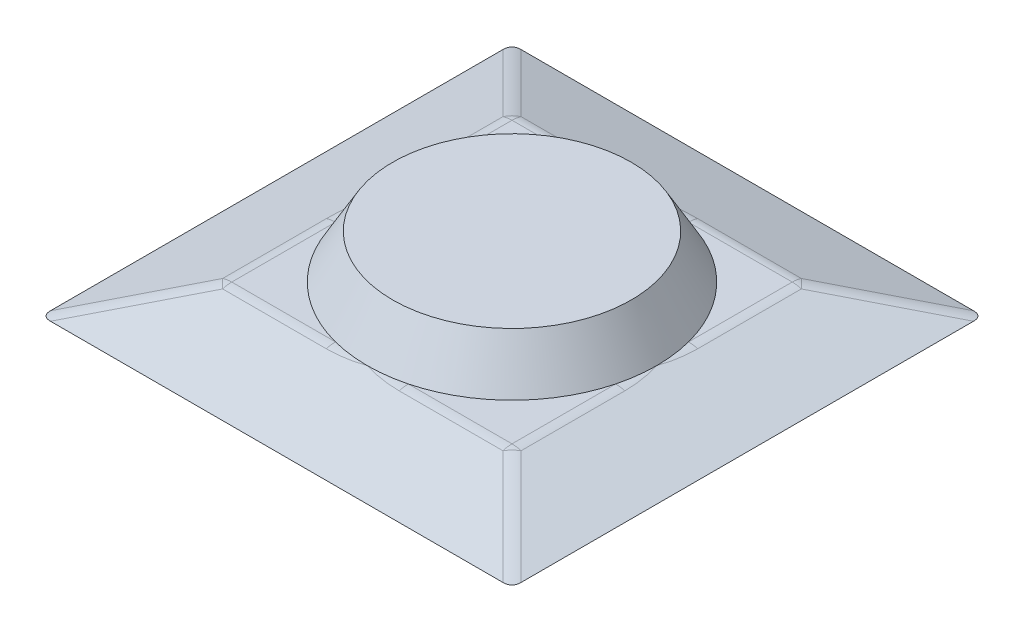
ISO-10303-21;
HEADER;
FILE_DESCRIPTION(('STEP AP214'),'2;1');
FILE_NAME('part.step','',(''),(''),'','','');
FILE_SCHEMA(('AUTOMOTIVE_DESIGN { 1 0 10303 214 1 1 1 1 }'));
ENDSEC;
DATA;
#1=APPLICATION_CONTEXT('core data for automotive mechanical design processes');
#2=APPLICATION_PROTOCOL_DEFINITION('international standard','automotive_design',2000,#1);
#3=PRODUCT_CONTEXT('',#1,'mechanical');
#4=PRODUCT('Part','Part','',(#3));
#5=PRODUCT_RELATED_PRODUCT_CATEGORY('part','',(#4));
#6=PRODUCT_DEFINITION_FORMATION('','',#4);
#7=PRODUCT_DEFINITION_CONTEXT('part definition',#1,'design');
#8=PRODUCT_DEFINITION('design','',#6,#7);
#9=PRODUCT_DEFINITION_SHAPE('','',#8);
#10=(LENGTH_UNIT() NAMED_UNIT(*) SI_UNIT(.MILLI.,.METRE.));
#11=(NAMED_UNIT(*) PLANE_ANGLE_UNIT() SI_UNIT($,.RADIAN.));
#12=(NAMED_UNIT(*) SI_UNIT($,.STERADIAN.) SOLID_ANGLE_UNIT());
#13=UNCERTAINTY_MEASURE_WITH_UNIT(LENGTH_MEASURE(1.E-05),#10,'distance_accuracy_value','');
#14=(GEOMETRIC_REPRESENTATION_CONTEXT(3) GLOBAL_UNCERTAINTY_ASSIGNED_CONTEXT((#13)) GLOBAL_UNIT_ASSIGNED_CONTEXT((#10,
#11,#12)) REPRESENTATION_CONTEXT('',''));
#15=CARTESIAN_POINT('',(0.,0.,0.));
#16=DIRECTION('',(0.,0.,1.));
#17=DIRECTION('',(1.,0.,0.));
#18=AXIS2_PLACEMENT_3D('',#15,#16,#17);
#19=CARTESIAN_POINT('',(0.,20.,0.));
#20=DIRECTION('',(0.,1.,0.));
#21=DIRECTION('',(0.,0.,1.));
#22=AXIS2_PLACEMENT_3D('',#19,#20,#21);
#23=PLANE('',#22);
#24=DIRECTION('',(-1.,0.,0.));
#25=VECTOR('',#24,1.);
#26=CARTESIAN_POINT('',(98.4463292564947,20.,95.278640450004));
#27=LINE('',#26,#25);
#28=CARTESIAN_POINT('',(24.7721702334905,20.,95.278640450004));
#29=VERTEX_POINT('',#28);
#30=CARTESIAN_POINT('',(95.278640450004,20.,95.278640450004));
#31=VERTEX_POINT('',#30);
#32=EDGE_CURVE('E377',#29,#31,#27,.F.);
#33=ORIENTED_EDGE('',*,*,#32,.T.);
#34=DIRECTION('',(0.,0.,1.));
#35=VECTOR('',#34,1.);
#36=CARTESIAN_POINT('',(95.278640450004,20.,0.));
#37=LINE('',#36,#35);
#38=CARTESIAN_POINT('',(95.278640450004,20.,24.7721702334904));
#39=VERTEX_POINT('',#38);
#40=EDGE_CURVE('E379',#31,#39,#37,.F.);
#41=ORIENTED_EDGE('',*,*,#40,.T.);
#42=CARTESIAN_POINT('',(0.,20.,0.));
#43=DIRECTION('',(0.,1.,0.));
#44=DIRECTION('',(0.,0.,1.));
#45=AXIS2_PLACEMENT_3D('',#42,#43,#44);
#46=CIRCLE('',#45,98.4463292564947);
#47=EDGE_CURVE('E209',#29,#39,#46,.T.);
#48=ORIENTED_EDGE('',*,*,#47,.F.);
#49=EDGE_LOOP('',(#33,#41,#48));
#50=FACE_BOUND('',#49,.T.);
#51=ADVANCED_FACE('F37',(#50),#23,.T.);
#52=CARTESIAN_POINT('',(95.278640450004,20.,-24.7721702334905));
#53=VERTEX_POINT('',#52);
#54=CARTESIAN_POINT('',(24.7721702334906,20.,-95.2786404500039));
#55=VERTEX_POINT('',#54);
#56=EDGE_CURVE('E226',#53,#55,#46,.T.);
#57=ORIENTED_EDGE('',*,*,#56,.F.);
#58=DIRECTION('',(0.,0.,1.));
#59=VECTOR('',#58,1.);
#60=CARTESIAN_POINT('',(95.278640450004,20.,-98.4463292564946));
#61=LINE('',#60,#59);
#62=CARTESIAN_POINT('',(95.278640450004,20.,-95.2786404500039));
#63=VERTEX_POINT('',#62);
#64=EDGE_CURVE('E383',#53,#63,#61,.F.);
#65=ORIENTED_EDGE('',*,*,#64,.T.);
#66=DIRECTION('',(1.,0.,0.));
#67=VECTOR('',#66,1.);
#68=CARTESIAN_POINT('',(0.,20.,-95.2786404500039));
#69=LINE('',#68,#67);
#70=EDGE_CURVE('E381',#63,#55,#69,.F.);
#71=ORIENTED_EDGE('',*,*,#70,.T.);
#72=EDGE_LOOP('',(#57,#65,#71));
#73=FACE_BOUND('',#72,.T.);
#74=ADVANCED_FACE('F524',(#73),#23,.T.);
#75=CARTESIAN_POINT('',(-24.7721702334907,20.,-95.2786404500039));
#76=VERTEX_POINT('',#75);
#77=CARTESIAN_POINT('',(-95.2786404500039,20.,-24.7721702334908));
#78=VERTEX_POINT('',#77);
#79=EDGE_CURVE('E220',#76,#78,#46,.T.);
#80=ORIENTED_EDGE('',*,*,#79,.F.);
#81=DIRECTION('',(1.,0.,0.));
#82=VECTOR('',#81,1.);
#83=CARTESIAN_POINT('',(-98.4463292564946,20.,-95.2786404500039));
#84=LINE('',#83,#82);
#85=CARTESIAN_POINT('',(-95.2786404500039,20.,-95.2786404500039));
#86=VERTEX_POINT('',#85);
#87=EDGE_CURVE('E387',#76,#86,#84,.F.);
#88=ORIENTED_EDGE('',*,*,#87,.T.);
#89=DIRECTION('',(0.,0.,-1.));
#90=VECTOR('',#89,1.);
#91=CARTESIAN_POINT('',(-95.2786404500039,20.,0.));
#92=LINE('',#91,#90);
#93=EDGE_CURVE('E385',#86,#78,#92,.F.);
#94=ORIENTED_EDGE('',*,*,#93,.T.);
#95=EDGE_LOOP('',(#80,#88,#94));
#96=FACE_BOUND('',#95,.T.);
#97=ADVANCED_FACE('F529',(#96),#23,.T.);
#98=CARTESIAN_POINT('',(-160.,0.,160.));
#99=DIRECTION('',(-0.309016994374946,0.951056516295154,0.));
#100=DIRECTION('',(-0.951056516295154,-0.309016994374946,0.));
#101=AXIS2_PLACEMENT_3D('',#98,#99,#100);
#102=PLANE('',#101);
#103=DIRECTION('',(0.,0.,1.));
#104=VECTOR('',#103,1.);
#105=CARTESIAN_POINT('',(-101.458980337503,19.0211303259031,-98.4463292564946));
#106=LINE('',#105,#104);
#107=CARTESIAN_POINT('',(-101.458980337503,19.0211303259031,-24.7721702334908));
#108=VERTEX_POINT('',#107);
#109=CARTESIAN_POINT('',(-101.458980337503,19.0211303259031,-95.2786404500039));
#110=VERTEX_POINT('',#109);
#111=EDGE_CURVE('E555',#108,#110,#106,.F.);
#112=ORIENTED_EDGE('',*,*,#111,.T.);
#113=DIRECTION('',(0.689151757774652,0.223918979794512,0.689151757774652));
#114=VECTOR('',#113,1.);
#115=CARTESIAN_POINT('',(-10.9575832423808,48.4268167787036,-4.77724335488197));
#116=LINE('',#115,#114);
#117=CARTESIAN_POINT('',(-160.,0.,-153.819660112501));
#118=VERTEX_POINT('',#117);
#119=EDGE_CURVE('E198',#110,#118,#116,.F.);
#120=ORIENTED_EDGE('',*,*,#119,.T.);
#121=DIRECTION('',(0.,0.,1.));
#122=VECTOR('',#121,1.);
#123=CARTESIAN_POINT('',(-160.,0.,160.));
#124=LINE('',#123,#122);
#125=CARTESIAN_POINT('',(-160.,0.,153.819660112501));
#126=VERTEX_POINT('',#125);
#127=EDGE_CURVE('E212',#118,#126,#124,.T.);
#128=ORIENTED_EDGE('',*,*,#127,.T.);
#129=DIRECTION('',(0.689151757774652,0.223918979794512,-0.689151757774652));
#130=VECTOR('',#129,1.);
#131=CARTESIAN_POINT('',(-162.935229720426,-0.95371394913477,156.754889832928));
#132=LINE('',#131,#130);
#133=CARTESIAN_POINT('',(-101.458980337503,19.0211303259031,95.278640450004));
#134=VERTEX_POINT('',#133);
#135=EDGE_CURVE('E655',#126,#134,#132,.T.);
#136=ORIENTED_EDGE('',*,*,#135,.T.);
#137=DIRECTION('',(0.,0.,1.));
#138=VECTOR('',#137,1.);
#139=CARTESIAN_POINT('',(-101.458980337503,19.0211303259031,0.));
#140=LINE('',#139,#138);
#141=CARTESIAN_POINT('',(-101.458980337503,19.0211303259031,24.7721702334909));
#142=VERTEX_POINT('',#141);
#143=EDGE_CURVE('E641',#134,#142,#140,.F.);
#144=ORIENTED_EDGE('',*,*,#143,.T.);
#145=CARTESIAN_POINT('',(-98.4463292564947,20.,0.));
#146=CARTESIAN_POINT('',(-98.4463292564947,20.,0.));
#147=CARTESIAN_POINT('',(-98.4463292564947,20.,2.85158074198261E-07));
#148=CARTESIAN_POINT('',(-98.4506697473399,19.998589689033,0.0176329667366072));
#149=CARTESIAN_POINT('',(-98.4484994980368,19.9992948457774,0.0182237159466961));
#150=CARTESIAN_POINT('',(-98.4463292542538,20.,0.0188145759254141));
#151=CARTESIAN_POINT('',(-98.4550055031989,19.9971809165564,0.0352671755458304));
#152=CARTESIAN_POINT('',(-98.4506649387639,19.9985912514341,0.0364472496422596));
#153=CARTESIAN_POINT('',(-98.4463238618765,20.,0.0376273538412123));
#154=CARTESIAN_POINT('',(-98.4636677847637,19.9943663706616,0.0705384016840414));
#155=CARTESIAN_POINT('',(-98.4549863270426,19.9971871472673,0.0728944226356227));
#156=CARTESIAN_POINT('',(-98.4463022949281,20.,0.0752504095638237));
#157=CARTESIAN_POINT('',(-98.4679943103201,19.9929605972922,0.088175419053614));
#158=CARTESIAN_POINT('',(-98.4571422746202,19.9964866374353,0.0911180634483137));
#159=CARTESIAN_POINT('',(-98.4462861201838,20.,0.0940606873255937));
#160=CARTESIAN_POINT('',(-98.9646153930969,19.8315986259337,2.11492961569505));
#161=CARTESIAN_POINT('',(-98.7043336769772,19.9161692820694,2.18515092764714));
#162=CARTESIAN_POINT('',(-98.4438079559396,20.,2.25533443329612));
#163=CARTESIAN_POINT('',(-99.3976860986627,19.6908854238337,4.14069254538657));
#164=CARTESIAN_POINT('',(-98.8881552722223,19.8564420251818,4.2620263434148));
#165=CARTESIAN_POINT('',(-98.3713911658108,20.,4.38106646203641));
#166=CARTESIAN_POINT('',(-100.142617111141,19.4488426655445,8.21721610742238));
#167=CARTESIAN_POINT('',(-99.1325097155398,19.7770464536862,8.40513254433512));
#168=CARTESIAN_POINT('',(-98.0935514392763,20.,8.58987434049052));
#169=CARTESIAN_POINT('',(-100.454430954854,19.3475282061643,10.2679860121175));
#170=CARTESIAN_POINT('',(-99.1929885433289,19.7573956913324,10.4734843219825));
#171=CARTESIAN_POINT('',(-97.8880775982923,20.,10.6729335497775));
#172=CARTESIAN_POINT('',(-100.95514969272,19.1848348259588,14.3900945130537));
#173=CARTESIAN_POINT('',(-99.1908830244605,19.7580798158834,14.5951839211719));
#174=CARTESIAN_POINT('',(-97.3508260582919,20.,14.7925232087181));
#175=CARTESIAN_POINT('',(-101.143822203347,19.1235314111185,16.4614645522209));
#176=CARTESIAN_POINT('',(-99.1278072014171,19.7785743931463,16.6504893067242));
#177=CARTESIAN_POINT('',(-97.0188114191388,20.,16.8289587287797));
#178=CARTESIAN_POINT('',(-101.395741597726,19.0416778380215,20.6125566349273));
#179=CARTESIAN_POINT('',(-98.8789933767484,19.8594189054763,20.7338800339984));
#180=CARTESIAN_POINT('',(-96.2359821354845,20.,20.8446891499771));
#181=CARTESIAN_POINT('',(-101.458986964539,19.0211281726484,22.6922787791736));
#182=CARTESIAN_POINT('',(-98.6927585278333,19.9199302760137,22.7638163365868));
#183=CARTESIAN_POINT('',(-95.7851660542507,20.,22.8239833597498));
#184=CARTESIAN_POINT('',(-101.458971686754,19.0211331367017,27.4872029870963));
#185=CARTESIAN_POINT('',(-98.1231560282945,20.1050053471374,27.4059734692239));
#186=CARTESIAN_POINT('',(-94.6174359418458,20.,27.3152794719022));
#187=CARTESIAN_POINT('',(-101.351181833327,19.0561561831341,30.2025242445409));
#188=CARTESIAN_POINT('',(-97.6959912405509,20.2437996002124,30.0063207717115));
#189=CARTESIAN_POINT('',(-93.8613025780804,20.,29.8053819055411));
#190=CARTESIAN_POINT('',(-100.918821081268,19.1966387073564,35.6148724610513));
#191=CARTESIAN_POINT('',(-96.6395346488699,20.5870631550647,35.1280407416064));
#192=CARTESIAN_POINT('',(-92.1754147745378,20.,34.6698751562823));
#193=CARTESIAN_POINT('',(-100.594203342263,19.3021134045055,38.3118953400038));
#194=CARTESIAN_POINT('',(-96.008035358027,20.7922497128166,37.6526339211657));
#195=CARTESIAN_POINT('',(-91.2456228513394,20.,37.0442408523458));
#196=CARTESIAN_POINT('',(-99.9451138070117,19.5130153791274,42.3290437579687));
#197=CARTESIAN_POINT('',(-94.9162634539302,21.1469879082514,41.3586763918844));
#198=CARTESIAN_POINT('',(-89.7326283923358,20.,40.5133294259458));
#199=CARTESIAN_POINT('',(-99.7015374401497,19.5921581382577,43.6641186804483));
#200=CARTESIAN_POINT('',(-94.526361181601,21.2736748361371,42.5855789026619));
#201=CARTESIAN_POINT('',(-89.208244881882,20.,41.6549095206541));
#202=CARTESIAN_POINT('',(-99.1604805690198,19.76795817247,46.3222302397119));
#203=CARTESIAN_POINT('',(-93.6982051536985,21.5427590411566,45.0128911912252));
#204=CARTESIAN_POINT('',(-88.1219158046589,20.,43.9063731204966));
#205=CARTESIAN_POINT('',(-98.8630001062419,19.864615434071,47.645266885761));
#206=CARTESIAN_POINT('',(-93.2595874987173,21.6852745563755,46.2136005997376));
#207=CARTESIAN_POINT('',(-87.5599702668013,20.,45.0162566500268));
#208=CARTESIAN_POINT('',(-98.214469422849,20.0753358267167,50.2766829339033));
#209=CARTESIAN_POINT('',(-92.3350488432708,21.9856753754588,48.5860036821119));
#210=CARTESIAN_POINT('',(-86.4004533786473,20.,47.2035350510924));
#211=CARTESIAN_POINT('',(-97.8634208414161,20.1893984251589,51.5850627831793));
#212=CARTESIAN_POINT('',(-91.8487383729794,22.1436872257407,49.7579586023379));
#213=CARTESIAN_POINT('',(-85.8028831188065,20.,48.2809309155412));
#214=CARTESIAN_POINT('',(-97.1081849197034,20.434789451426,54.1847815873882));
#215=CARTESIAN_POINT('',(-90.8299739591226,22.474703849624,52.0706342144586));
#216=CARTESIAN_POINT('',(-84.5738863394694,20.,50.4027830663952));
#217=CARTESIAN_POINT('',(-96.7039965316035,20.5661182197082,55.4761202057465));
#218=CARTESIAN_POINT('',(-90.2971031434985,22.6478440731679,53.2115754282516));
#219=CARTESIAN_POINT('',(-83.9424591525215,20.,51.4472387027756));
#220=CARTESIAN_POINT('',(-96.2734639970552,20.7060067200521,56.7576999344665));
#221=CARTESIAN_POINT('',(-89.7432874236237,22.8277897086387,54.3324538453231));
#222=CARTESIAN_POINT('',(-83.2950078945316,20.,52.4749597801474));
#223=(BOUNDED_SURFACE() B_SPLINE_SURFACE(3,2,((#145,#146,#147),(#148,#149,#150),(#151,#152,
#153),(#154,#155,#156),(#157,#158,#159),(#160,#161,#162),(#163,#164,#165),(#166,#167,#168),
(#169,#170,#171),(#172,#173,#174),(#175,#176,#177),(#178,#179,#180),(#181,#182,#183),(#184,#185,
#186),(#187,#188,#189),(#190,#191,#192),(#193,#194,#195),(#196,#197,#198),(#199,#200,#201),
(#202,#203,#204),(#205,#206,#207),(#208,#209,#210),(#211,#212,#213),(#214,#215,#216),(#217,#218,
#219),(#220,#221,#222)),.UNSPECIFIED.,.F.,.F.,.F.) B_SPLINE_SURFACE_WITH_KNOTS((4,2,2,2,2,2,2,2,
2,2,2,2,4),(3,3),(0.,0.0546419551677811,0.109284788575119,6.33345506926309,12.5600079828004,
18.7982774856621,25.0366224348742,33.1799853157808,41.3251079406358,45.4023418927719,
49.4795727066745,53.5566787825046,57.6338652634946),(0.,1.),
.UNSPECIFIED.) GEOMETRIC_REPRESENTATION_ITEM() RATIONAL_B_SPLINE_SURFACE(((1.,1.,1.),(1.,
0.999999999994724,1.),(1.,0.999999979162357,1.),(1.,0.999999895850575,1.),(1.,0.999999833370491,
1.),(1.,0.999990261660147,1.),(1.,0.99971064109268,1.),(1.,0.998636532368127,1.),(1.,
0.997841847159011,1.),(1.,0.995759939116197,1.),(1.,0.994471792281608,1.),(1.,0.991426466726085,
1.),(1.,0.989669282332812,1.),(1.,0.985102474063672,1.),(1.,0.982135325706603,1.),(1.,
0.975482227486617,1.),(1.,0.971796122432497,1.),(1.,0.965757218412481,1.),(1.,0.96365794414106,
1.),(1.,0.959293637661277,1.),(1.,0.957028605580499,1.),(1.,0.952337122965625,1.),(1.,
0.949910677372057,1.),(1.,0.944899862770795,1.),(1.,0.942315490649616,1.),(1.,0.939653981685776,1.))) REPRESENTATION_ITEM('') SURFACE());
#224=CARTESIAN_POINT('',(-96.2734639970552,20.7060067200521,56.7576999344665));
#225=CARTESIAN_POINT('',(-96.7039965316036,20.5661182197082,55.4761202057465));
#226=CARTESIAN_POINT('',(-97.1081849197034,20.434789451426,54.1847815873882));
#227=CARTESIAN_POINT('',(-97.8634208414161,20.1893984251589,51.5850627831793));
#228=CARTESIAN_POINT('',(-98.214469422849,20.0753358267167,50.2766829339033));
#229=CARTESIAN_POINT('',(-98.8630001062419,19.864615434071,47.645266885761));
#230=CARTESIAN_POINT('',(-99.1604805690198,19.76795817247,46.3222302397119));
#231=CARTESIAN_POINT('',(-99.7015374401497,19.5921581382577,43.6641186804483));
#232=CARTESIAN_POINT('',(-99.9451138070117,19.5130153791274,42.3290437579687));
#233=CARTESIAN_POINT('',(-100.594203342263,19.3021134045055,38.3118953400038));
#234=CARTESIAN_POINT('',(-100.918821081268,19.1966387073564,35.6148724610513));
#235=CARTESIAN_POINT('',(-101.351181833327,19.0561561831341,30.2025242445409));
#236=CARTESIAN_POINT('',(-101.458971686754,19.0211331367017,27.4872029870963));
#237=CARTESIAN_POINT('',(-101.458986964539,19.0211281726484,22.6922787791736));
#238=CARTESIAN_POINT('',(-101.395741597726,19.0416778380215,20.6125566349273));
#239=CARTESIAN_POINT('',(-101.143822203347,19.1235314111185,16.4614645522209));
#240=CARTESIAN_POINT('',(-100.95514969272,19.1848348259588,14.3900945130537));
#241=CARTESIAN_POINT('',(-100.454430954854,19.3475282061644,10.2679860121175));
#242=CARTESIAN_POINT('',(-100.142617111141,19.4488426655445,8.21721610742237));
#243=CARTESIAN_POINT('',(-99.3976860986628,19.6908854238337,4.14069254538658));
#244=CARTESIAN_POINT('',(-98.9646153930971,19.8315986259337,2.11492961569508));
#245=CARTESIAN_POINT('',(-98.4679943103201,19.9929605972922,0.088175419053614));
#246=CARTESIAN_POINT('',(-98.4636677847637,19.9943663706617,0.0705384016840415));
#247=CARTESIAN_POINT('',(-98.4550055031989,19.9971809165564,0.0352671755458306));
#248=CARTESIAN_POINT('',(-98.4506697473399,19.998589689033,0.0176329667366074));
#249=CARTESIAN_POINT('',(-98.4463292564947,20.,0.));
#250=B_SPLINE_CURVE_WITH_KNOTS('',3,(#224,#225,#226,#227,#228,#229,#230,#231,#232,#233,#234,
#235,#236,#237,#238,#239,#240,#241,#242,#243,#244,#245,#246,#247,#248,#249),.UNSPECIFIED.,.F.,
.F.,(4,2,2,2,2,2,2,2,2,2,2,2,4),(0.,4.07718648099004,8.1542925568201,12.2315233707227,
16.3087573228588,24.4538799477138,32.5972428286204,38.8355877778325,45.0738572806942,
51.3004101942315,57.5245804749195,57.5792233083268,57.6338652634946),.UNSPECIFIED.);
#251=CARTESIAN_POINT('',(-98.4463292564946,20.,0.));
#252=VERTEX_POINT('',#251);
#253=EDGE_CURVE('E638',#142,#252,#250,.T.);
#254=ORIENTED_EDGE('',*,*,#253,.T.);
#255=CARTESIAN_POINT('',(-98.4463292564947,20.,2.85158074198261E-07));
#256=CARTESIAN_POINT('',(-98.4463292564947,20.,2.85158074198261E-07));
#257=CARTESIAN_POINT('',(-98.4463292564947,20.,0.));
#258=CARTESIAN_POINT('',(-98.4463292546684,20.,-0.0188136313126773));
#259=CARTESIAN_POINT('',(-98.4484994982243,19.9992948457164,-0.0182232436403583));
#260=CARTESIAN_POINT('',(-98.4506697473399,19.998589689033,-0.0176329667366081));
#261=CARTESIAN_POINT('',(-98.4463238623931,20.,-0.0376263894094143));
#262=CARTESIAN_POINT('',(-98.4506649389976,19.9985912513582,-0.0364467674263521));
#263=CARTESIAN_POINT('',(-98.4550055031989,19.9971809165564,-0.0352671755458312));
#264=CARTESIAN_POINT('',(-98.4463022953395,20.,-0.0752497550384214));
#265=CARTESIAN_POINT('',(-98.4549863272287,19.9971871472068,-0.0728940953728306));
#266=CARTESIAN_POINT('',(-98.4636677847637,19.9943663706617,-0.0705384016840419));
#267=CARTESIAN_POINT('',(-98.4462861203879,20.,-0.0940603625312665));
#268=CARTESIAN_POINT('',(-98.4571422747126,19.9964866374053,-0.0911179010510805));
#269=CARTESIAN_POINT('',(-98.46799431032,19.9929605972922,-0.0881754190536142));
#270=CARTESIAN_POINT('',(-98.4438079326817,20.,-2.25537142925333));
#271=CARTESIAN_POINT('',(-98.7043336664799,19.9161692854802,-2.18516942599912));
#272=CARTESIAN_POINT('',(-98.9646153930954,19.8315986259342,-2.11492961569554));
#273=CARTESIAN_POINT('',(-98.3713911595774,20.,-4.38107637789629));
#274=CARTESIAN_POINT('',(-98.8881552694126,19.8564420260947,-4.26203130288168));
#275=CARTESIAN_POINT('',(-99.3976860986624,19.6908854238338,-4.14069254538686));
#276=CARTESIAN_POINT('',(-98.0935514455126,20.,-8.58986442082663));
#277=CARTESIAN_POINT('',(-99.1325097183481,19.7770464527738,-8.40512757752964));
#278=CARTESIAN_POINT('',(-100.142617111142,19.4488426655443,-8.21721610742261));
#279=CARTESIAN_POINT('',(-97.8880775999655,20.,-10.6729308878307));
#280=CARTESIAN_POINT('',(-99.1929885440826,19.7573956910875,-10.473482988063));
#281=CARTESIAN_POINT('',(-100.454430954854,19.3475282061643,-10.2679860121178));
#282=CARTESIAN_POINT('',(-97.3508260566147,20.,-14.7925258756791));
#283=CARTESIAN_POINT('',(-99.1908830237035,19.7580798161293,-14.5951852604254));
#284=CARTESIAN_POINT('',(-100.95514969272,19.1848348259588,-14.390094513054));
#285=CARTESIAN_POINT('',(-97.0188114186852,20.,-16.8289594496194));
#286=CARTESIAN_POINT('',(-99.127807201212,19.778574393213,-16.6504896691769));
#287=CARTESIAN_POINT('',(-101.143822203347,19.1235314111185,-16.4614645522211));
#288=CARTESIAN_POINT('',(-96.2359821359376,20.,-20.8446884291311));
#289=CARTESIAN_POINT('',(-98.8789933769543,19.8594189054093,-20.733879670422));
#290=CARTESIAN_POINT('',(-101.395741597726,19.0416778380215,-20.6125566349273));
#291=CARTESIAN_POINT('',(-95.7851660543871,20.,-22.8239831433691));
#292=CARTESIAN_POINT('',(-98.6927585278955,19.9199302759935,-22.763816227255));
#293=CARTESIAN_POINT('',(-101.458986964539,19.0211281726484,-22.6922787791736));
#294=CARTESIAN_POINT('',(-94.6174359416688,20.,-27.3152797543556));
#295=CARTESIAN_POINT('',(-98.1231560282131,20.1050053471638,-27.4059736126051));
#296=CARTESIAN_POINT('',(-101.458971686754,19.0211331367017,-27.4872029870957));
#297=CARTESIAN_POINT('',(-93.8613025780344,20.,-29.8053819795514));
#298=CARTESIAN_POINT('',(-97.6959912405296,20.2437996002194,-30.0063208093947));
#299=CARTESIAN_POINT('',(-101.351181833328,19.0561561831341,-30.2025242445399));
#300=CARTESIAN_POINT('',(-92.1754147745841,20.,-34.6698750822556));
#301=CARTESIAN_POINT('',(-96.6395346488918,20.5870631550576,-35.1280407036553));
#302=CARTESIAN_POINT('',(-100.918821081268,19.1966387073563,-35.6148724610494));
#303=CARTESIAN_POINT('',(-91.2456228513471,20.,-37.0442408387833));
#304=CARTESIAN_POINT('',(-96.0080353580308,20.7922497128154,-37.6526339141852));
#305=CARTESIAN_POINT('',(-100.594203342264,19.3021134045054,-38.3118953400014));
#306=CARTESIAN_POINT('',(-89.7326283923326,20.,-40.5133294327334));
#307=CARTESIAN_POINT('',(-94.9162634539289,21.1469879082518,-41.3586763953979));
#308=CARTESIAN_POINT('',(-99.9451138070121,19.5130153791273,-42.3290437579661));
#309=CARTESIAN_POINT('',(-89.2082448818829,20.,-41.6549095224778));
#310=CARTESIAN_POINT('',(-94.5263611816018,21.2736748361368,-42.5855789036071));
#311=CARTESIAN_POINT('',(-99.7015374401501,19.5921581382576,-43.6641186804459));
#312=CARTESIAN_POINT('',(-88.1219158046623,20.,-43.906373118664));
#313=CARTESIAN_POINT('',(-93.6982051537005,21.542759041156,-45.0128911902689));
#314=CARTESIAN_POINT('',(-99.1604805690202,19.7679581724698,-46.3222302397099));
#315=CARTESIAN_POINT('',(-87.559970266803,20.,-45.0162566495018));
#316=CARTESIAN_POINT('',(-93.2595874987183,21.6852745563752,-46.2136005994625));
#317=CARTESIAN_POINT('',(-98.8630001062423,19.8646154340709,-47.6452668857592));
#318=CARTESIAN_POINT('',(-86.4004533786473,20.,-47.2035350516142));
#319=CARTESIAN_POINT('',(-92.3350488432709,21.9856753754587,-48.5860036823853));
#320=CARTESIAN_POINT('',(-98.2144694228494,20.0753358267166,-50.276682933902));
#321=CARTESIAN_POINT('',(-85.8028831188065,20.,-48.2809309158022));
#322=CARTESIAN_POINT('',(-91.8487383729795,22.1436872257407,-49.7579586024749));
#323=CARTESIAN_POINT('',(-97.8634208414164,20.1893984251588,-51.5850627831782));
#324=CARTESIAN_POINT('',(-84.5738863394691,20.,-50.4027830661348));
#325=CARTESIAN_POINT('',(-90.8299739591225,22.474703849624,-52.0706342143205));
#326=CARTESIAN_POINT('',(-97.1081849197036,20.4347894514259,-54.1847815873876));
#327=CARTESIAN_POINT('',(-83.9424591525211,20.,-51.4472387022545));
#328=CARTESIAN_POINT('',(-90.2971031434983,22.647844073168,-53.2115754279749));
#329=CARTESIAN_POINT('',(-96.7039965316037,20.5661182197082,-55.4761202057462));
#330=CARTESIAN_POINT('',(-83.29500789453,20.,-52.4749597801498));
#331=CARTESIAN_POINT('',(-89.7432874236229,22.8277897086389,-54.3324538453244));
#332=CARTESIAN_POINT('',(-96.2734639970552,20.706006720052,-56.7576999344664));
#333=(BOUNDED_SURFACE() B_SPLINE_SURFACE(3,2,((#255,#256,#257),(#258,#259,#260),(#261,#262,
#263),(#264,#265,#266),(#267,#268,#269),(#270,#271,#272),(#273,#274,#275),(#276,#277,#278),
(#279,#280,#281),(#282,#283,#284),(#285,#286,#287),(#288,#289,#290),(#291,#292,#293),(#294,#295,
#296),(#297,#298,#299),(#300,#301,#302),(#303,#304,#305),(#306,#307,#308),(#309,#310,#311),
(#312,#313,#314),(#315,#316,#317),(#318,#319,#320),(#321,#322,#323),(#324,#325,#326),(#327,#328,
#329),(#330,#331,#332)),.UNSPECIFIED.,.F.,.F.,.F.) B_SPLINE_SURFACE_WITH_KNOTS((4,2,2,2,2,2,2,2,
2,2,2,2,4),(3,3),(0.,0.0546419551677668,0.109284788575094,6.33345506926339,12.5600079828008,
18.7982774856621,25.0366224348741,33.1799853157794,41.3251079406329,45.4023418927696,
49.4795727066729,53.5566787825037,57.6338652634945),(0.,1.),
.UNSPECIFIED.) GEOMETRIC_REPRESENTATION_ITEM() RATIONAL_B_SPLINE_SURFACE(((1.,1.,1.),(1.,
0.999999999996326,1.),(1.,0.999999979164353,1.),(1.,0.999999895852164,1.),(1.,0.99999983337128,
1.),(1.,0.999990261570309,1.),(1.,0.999710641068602,1.),(1.,0.998636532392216,1.),(1.,
0.997841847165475,1.),(1.,0.995759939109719,1.),(1.,0.994471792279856,1.),(1.,0.991426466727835,
1.),(1.,0.989669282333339,1.),(1.,0.985102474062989,1.),(1.,0.982135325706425,1.),(1.,
0.975482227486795,1.),(1.,0.971796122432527,1.),(1.,0.965757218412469,1.),(1.,0.963657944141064,
1.),(1.,0.95929363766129,1.),(1.,0.957028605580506,1.),(1.,0.952337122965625,1.),(1.,
0.949910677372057,1.),(1.,0.944899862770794,1.),(1.,0.942315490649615,1.),(1.,0.939653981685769,1.))) REPRESENTATION_ITEM('') SURFACE());
#334=CARTESIAN_POINT('',(-96.2734639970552,20.706006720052,-56.7576999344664));
#335=CARTESIAN_POINT('',(-96.7039965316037,20.5661182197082,-55.4761202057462));
#336=CARTESIAN_POINT('',(-97.1081849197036,20.4347894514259,-54.1847815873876));
#337=CARTESIAN_POINT('',(-97.8634208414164,20.1893984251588,-51.5850627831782));
#338=CARTESIAN_POINT('',(-98.2144694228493,20.0753358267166,-50.276682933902));
#339=CARTESIAN_POINT('',(-98.8630001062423,19.8646154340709,-47.6452668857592));
#340=CARTESIAN_POINT('',(-99.1604805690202,19.7679581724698,-46.3222302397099));
#341=CARTESIAN_POINT('',(-99.7015374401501,19.5921581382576,-43.6641186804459));
#342=CARTESIAN_POINT('',(-99.9451138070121,19.5130153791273,-42.3290437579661));
#343=CARTESIAN_POINT('',(-100.594203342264,19.3021134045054,-38.3118953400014));
#344=CARTESIAN_POINT('',(-100.918821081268,19.1966387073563,-35.6148724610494));
#345=CARTESIAN_POINT('',(-101.351181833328,19.0561561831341,-30.2025242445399));
#346=CARTESIAN_POINT('',(-101.458971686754,19.0211331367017,-27.4872029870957));
#347=CARTESIAN_POINT('',(-101.458986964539,19.0211281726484,-22.6922787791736));
#348=CARTESIAN_POINT('',(-101.395741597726,19.0416778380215,-20.6125566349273));
#349=CARTESIAN_POINT('',(-101.143822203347,19.1235314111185,-16.4614645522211));
#350=CARTESIAN_POINT('',(-100.95514969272,19.1848348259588,-14.390094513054));
#351=CARTESIAN_POINT('',(-100.454430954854,19.3475282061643,-10.2679860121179));
#352=CARTESIAN_POINT('',(-100.142617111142,19.4488426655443,-8.21721610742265));
#353=CARTESIAN_POINT('',(-99.3976860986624,19.6908854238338,-4.14069254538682));
#354=CARTESIAN_POINT('',(-98.9646153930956,19.8315986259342,-2.1149296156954));
#355=CARTESIAN_POINT('',(-98.46799431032,19.9929605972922,-0.0881754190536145));
#356=CARTESIAN_POINT('',(-98.4636677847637,19.9943663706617,-0.0705384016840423));
#357=CARTESIAN_POINT('',(-98.4550055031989,19.9971809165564,-0.0352671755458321));
#358=CARTESIAN_POINT('',(-98.4506697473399,19.998589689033,-0.0176329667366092));
#359=CARTESIAN_POINT('',(-98.4463292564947,20.,0.));
#360=B_SPLINE_CURVE_WITH_KNOTS('',3,(#334,#335,#336,#337,#338,#339,#340,#341,#342,#343,#344,
#345,#346,#347,#348,#349,#350,#351,#352,#353,#354,#355,#356,#357,#358,#359),.UNSPECIFIED.,.F.,
.F.,(4,2,2,2,2,2,2,2,2,2,2,2,4),(0.,4.0771864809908,8.1542925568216,12.2315233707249,
16.3087573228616,24.4538799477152,32.5972428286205,38.8355877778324,45.0738572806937,
51.3004101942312,57.5245804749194,57.5792233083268,57.6338652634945),.UNSPECIFIED.);
#361=EDGE_CURVE('E552',#252,#108,#360,.F.);
#362=ORIENTED_EDGE('',*,*,#361,.T.);
#363=EDGE_LOOP('',(#112,#120,#128,#136,#144,#254,#362));
#364=FACE_BOUND('',#363,.T.);
#365=ADVANCED_FACE('F342',(#364),#102,.T.);
#366=CARTESIAN_POINT('',(160.,0.,160.));
#367=DIRECTION('',(0.,0.951056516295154,0.309016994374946));
#368=DIRECTION('',(0.,-0.309016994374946,0.951056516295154));
#369=AXIS2_PLACEMENT_3D('',#366,#367,#368);
#370=PLANE('',#369);
#371=DIRECTION('',(1.,0.,0.));
#372=VECTOR('',#371,1.);
#373=CARTESIAN_POINT('',(-98.4463292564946,19.0211303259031,101.458980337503));
#374=LINE('',#373,#372);
#375=CARTESIAN_POINT('',(-24.7721702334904,19.0211303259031,101.458980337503));
#376=VERTEX_POINT('',#375);
#377=CARTESIAN_POINT('',(-95.2786404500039,19.0211303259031,101.458980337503));
#378=VERTEX_POINT('',#377);
#379=EDGE_CURVE('E372',#376,#378,#374,.F.);
#380=ORIENTED_EDGE('',*,*,#379,.T.);
#381=DIRECTION('',(0.689151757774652,0.223918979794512,-0.689151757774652));
#382=VECTOR('',#381,1.);
#383=CARTESIAN_POINT('',(-4.77724335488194,48.4268167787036,10.957583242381));
#384=LINE('',#383,#382);
#385=CARTESIAN_POINT('',(-153.819660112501,0.,160.));
#386=VERTEX_POINT('',#385);
#387=EDGE_CURVE('E374',#378,#386,#384,.F.);
#388=ORIENTED_EDGE('',*,*,#387,.T.);
#389=DIRECTION('',(1.,0.,0.));
#390=VECTOR('',#389,1.);
#391=CARTESIAN_POINT('',(160.,0.,160.));
#392=LINE('',#391,#390);
#393=CARTESIAN_POINT('',(153.819660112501,0.,160.));
#394=VERTEX_POINT('',#393);
#395=EDGE_CURVE('E661',#386,#394,#392,.T.);
#396=ORIENTED_EDGE('',*,*,#395,.T.);
#397=DIRECTION('',(-0.689151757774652,0.223918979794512,-0.689151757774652));
#398=VECTOR('',#397,1.);
#399=CARTESIAN_POINT('',(156.754889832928,-0.95371394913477,162.935229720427));
#400=LINE('',#399,#398);
#401=CARTESIAN_POINT('',(95.278640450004,19.0211303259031,101.458980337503));
#402=VERTEX_POINT('',#401);
#403=EDGE_CURVE('E203',#394,#402,#400,.T.);
#404=ORIENTED_EDGE('',*,*,#403,.T.);
#405=DIRECTION('',(1.,0.,0.));
#406=VECTOR('',#405,1.);
#407=CARTESIAN_POINT('',(0.,19.0211303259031,101.458980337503));
#408=LINE('',#407,#406);
#409=CARTESIAN_POINT('',(24.7721702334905,19.0211303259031,101.458980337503));
#410=VERTEX_POINT('',#409);
#411=EDGE_CURVE('E195',#402,#410,#408,.F.);
#412=ORIENTED_EDGE('',*,*,#411,.T.);
#413=CARTESIAN_POINT('',(0.,20.,98.4463292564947));
#414=CARTESIAN_POINT('',(0.,20.,98.4463292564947));
#415=CARTESIAN_POINT('',(1.64636140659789E-07,20.,98.4463292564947));
#416=CARTESIAN_POINT('',(0.0176329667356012,19.9985896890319,98.4506697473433));
#417=CARTESIAN_POINT('',(0.0182235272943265,19.999294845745,98.4484994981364));
#418=CARTESIAN_POINT('',(0.0188141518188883,20.,98.4463292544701));
#419=CARTESIAN_POINT('',(0.0352671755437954,19.9971809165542,98.4550055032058));
#420=CARTESIAN_POINT('',(0.0364470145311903,19.9985912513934,98.4506649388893));
#421=CARTESIAN_POINT('',(0.037626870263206,20.,98.446323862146));
#422=CARTESIAN_POINT('',(0.070538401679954,19.9943663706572,98.4636677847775));
#423=CARTESIAN_POINT('',(0.0728942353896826,19.9971871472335,98.4549863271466));
#424=CARTESIAN_POINT('',(0.0752500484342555,20.,98.4463022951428));
#425=CARTESIAN_POINT('',(0.0881754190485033,19.9929605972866,98.4679943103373));
#426=CARTESIAN_POINT('',(0.0911179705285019,19.9964866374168,98.4571422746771));
#427=CARTESIAN_POINT('',(0.094060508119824,20.,98.4462861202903));
#428=CARTESIAN_POINT('',(2.11492961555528,19.831598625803,98.9646153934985));
#429=CARTESIAN_POINT('',(2.18516151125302,19.9161692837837,98.7043336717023));
#430=CARTESIAN_POINT('',(2.25535484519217,20.,98.443807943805));
#431=CARTESIAN_POINT('',(4.14069254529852,19.6908854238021,99.3976860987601));
#432=CARTESIAN_POINT('',(4.26202918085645,19.8564420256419,98.8881552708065));
#433=CARTESIAN_POINT('',(4.38107193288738,20.,98.3713911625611));
#434=CARTESIAN_POINT('',(8.21721610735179,19.4488426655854,100.142617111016));
#435=CARTESIAN_POINT('',(8.40512970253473,19.7770464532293,99.1325097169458));
#436=CARTESIAN_POINT('',(8.5898688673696,20.,98.0935514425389));
#437=CARTESIAN_POINT('',(10.2679860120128,19.3475282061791,100.454430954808));
#438=CARTESIAN_POINT('',(10.4734835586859,19.7573956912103,99.1929885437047));
#439=CARTESIAN_POINT('',(10.6729320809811,20.,97.8880775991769));
#440=CARTESIAN_POINT('',(14.3900945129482,19.1848348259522,100.95514969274));
#441=CARTESIAN_POINT('',(14.5951846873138,19.7580798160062,99.1908830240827));
#442=CARTESIAN_POINT('',(14.7925246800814,20.,97.3508260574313));
#443=CARTESIAN_POINT('',(16.4614645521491,19.1235314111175,101.14382220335));
#444=CARTESIAN_POINT('',(16.6504895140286,19.7785743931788,99.1278072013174));
#445=CARTESIAN_POINT('',(16.8289591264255,20.,97.0188114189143));
#446=CARTESIAN_POINT('',(20.6125566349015,19.0416778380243,101.395741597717));
#447=CARTESIAN_POINT('',(20.7338798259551,19.8594189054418,98.8789933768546));
#448=CARTESIAN_POINT('',(20.8446887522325,20.,96.2359821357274));
#449=CARTESIAN_POINT('',(22.6922787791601,19.0211281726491,101.458986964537));
#450=CARTESIAN_POINT('',(22.7638162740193,19.919930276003,98.6927585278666));
#451=CARTESIAN_POINT('',(22.8239832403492,20.,95.7851660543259));
#452=CARTESIAN_POINT('',(27.4872029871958,19.0211331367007,101.458971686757));
#453=CARTESIAN_POINT('',(27.4059735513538,20.1050053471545,98.123156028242));
#454=CARTESIAN_POINT('',(27.3152796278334,20.,94.6174359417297));
#455=CARTESIAN_POINT('',(30.2025242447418,19.0561561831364,101.35118183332));
#456=CARTESIAN_POINT('',(30.0063207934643,20.2437996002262,97.6959912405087));
#457=CARTESIAN_POINT('',(29.8053819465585,20.,93.8613025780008));
#458=CARTESIAN_POINT('',(35.6148724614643,19.19663870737,100.918821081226));
#459=CARTESIAN_POINT('',(35.1280407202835,20.5870631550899,96.6395346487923));
#460=CARTESIAN_POINT('',(34.6698751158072,20.,92.1754147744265));
#461=CARTESIAN_POINT('',(38.3118953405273,19.3021134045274,100.594203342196));
#462=CARTESIAN_POINT('',(37.6526339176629,20.7922497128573,96.008035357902));
#463=CARTESIAN_POINT('',(37.0442408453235,20.,91.2456228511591));
#464=CARTESIAN_POINT('',(42.3290437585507,19.5130153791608,99.945113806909));
#465=CARTESIAN_POINT('',(41.3586763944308,21.1469879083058,94.9162634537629));
#466=CARTESIAN_POINT('',(40.5133294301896,20.,89.7326283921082));
#467=CARTESIAN_POINT('',(43.6641186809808,19.5921581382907,99.7015374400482));
#468=CARTESIAN_POINT('',(42.5855789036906,21.2736748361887,94.5263611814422));
#469=CARTESIAN_POINT('',(41.6549095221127,20.,89.2082448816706));
#470=CARTESIAN_POINT('',(46.322230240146,19.7679581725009,99.1604805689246));
#471=CARTESIAN_POINT('',(45.0128911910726,21.5427590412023,93.6982051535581));
#472=CARTESIAN_POINT('',(43.9063731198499,20.,88.1219158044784));
#473=CARTESIAN_POINT('',(47.6452668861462,19.8646154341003,98.8630001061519));
#474=CARTESIAN_POINT('',(46.2136005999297,21.685274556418,93.2595874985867));
#475=CARTESIAN_POINT('',(45.0162566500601,20.,87.5599702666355));
#476=CARTESIAN_POINT('',(50.2766829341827,20.0753358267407,98.2144694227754));
#477=CARTESIAN_POINT('',(48.5860036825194,21.9856753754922,92.335048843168));
#478=CARTESIAN_POINT('',(47.2035350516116,20.,86.4004533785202));
#479=CARTESIAN_POINT('',(51.5850627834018,20.1893984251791,97.863420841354));
#480=CARTESIAN_POINT('',(49.7579586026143,22.1436872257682,91.8487383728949));
#481=CARTESIAN_POINT('',(48.2809309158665,20.,85.8028831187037));
#482=CARTESIAN_POINT('',(54.1847815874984,20.4347894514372,97.108184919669));
#483=CARTESIAN_POINT('',(52.0706342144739,22.4747038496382,90.8299739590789));
#484=CARTESIAN_POINT('',(50.4027830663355,20.,84.5738863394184));
#485=CARTESIAN_POINT('',(55.4761202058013,20.5661182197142,96.7039965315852));
#486=CARTESIAN_POINT('',(53.211575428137,22.6478440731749,90.2971031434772));
#487=CARTESIAN_POINT('',(51.4472387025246,20.,83.942459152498));
#488=CARTESIAN_POINT('',(56.7576999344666,20.7060067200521,96.2734639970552));
#489=CARTESIAN_POINT('',(54.3324538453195,22.8277897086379,89.7432874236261));
#490=CARTESIAN_POINT('',(52.4749597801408,20.,83.2950078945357));
#491=(BOUNDED_SURFACE() B_SPLINE_SURFACE(3,2,((#413,#414,#415),(#416,#417,#418),(#419,#420,
#421),(#422,#423,#424),(#425,#426,#427),(#428,#429,#430),(#431,#432,#433),(#434,#435,#436),
(#437,#438,#439),(#440,#441,#442),(#443,#444,#445),(#446,#447,#448),(#449,#450,#451),(#452,#453,
#454),(#455,#456,#457),(#458,#459,#460),(#461,#462,#463),(#464,#465,#466),(#467,#468,#469),
(#470,#471,#472),(#473,#474,#475),(#476,#477,#478),(#479,#480,#481),(#482,#483,#484),(#485,#486,
#487),(#488,#489,#490)),.UNSPECIFIED.,.F.,.F.,.F.) B_SPLINE_SURFACE_WITH_KNOTS((4,2,2,2,2,2,2,2,
2,2,2,2,4),(3,3),(0.,0.0546419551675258,0.109284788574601,6.33345506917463,12.560007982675,
18.7982774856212,25.0366224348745,33.1799853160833,41.3251079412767,45.4023418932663,
49.4795727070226,53.5566787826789,57.633865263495),(0.,1.),
.UNSPECIFIED.) GEOMETRIC_REPRESENTATION_ITEM() RATIONAL_B_SPLINE_SURFACE(((1.,1.,1.),(1.,
0.99999999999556,1.),(1.,0.999999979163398,1.),(1.,0.999999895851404,1.),(1.,0.999999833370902,
1.),(1.,0.99999026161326,1.),(1.,0.999710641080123,1.),(1.,0.998636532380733,1.),(1.,
0.997841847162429,1.),(1.,0.995759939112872,1.),(1.,0.99447179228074,1.),(1.,0.991426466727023,
1.),(1.,0.989669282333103,1.),(1.,0.985102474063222,1.),(1.,0.982135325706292,1.),(1.,
0.975482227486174,1.),(1.,0.971796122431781,1.),(1.,0.965757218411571,1.),(1.,0.963657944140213,
1.),(1.,0.95929363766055,1.),(1.,0.957028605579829,1.),(1.,0.952337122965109,1.),(1.,
0.949910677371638,1.),(1.,0.944899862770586,1.),(1.,0.942315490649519,1.),(1.,0.939653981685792,1.))) REPRESENTATION_ITEM('') SURFACE());
#492=CARTESIAN_POINT('',(56.7576999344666,20.7060067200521,96.2734639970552));
#493=CARTESIAN_POINT('',(55.4761202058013,20.5661182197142,96.7039965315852));
#494=CARTESIAN_POINT('',(54.1847815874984,20.4347894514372,97.108184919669));
#495=CARTESIAN_POINT('',(51.5850627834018,20.1893984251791,97.863420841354));
#496=CARTESIAN_POINT('',(50.2766829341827,20.0753358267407,98.2144694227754));
#497=CARTESIAN_POINT('',(47.6452668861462,19.8646154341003,98.8630001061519));
#498=CARTESIAN_POINT('',(46.322230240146,19.7679581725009,99.1604805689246));
#499=CARTESIAN_POINT('',(43.6641186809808,19.5921581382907,99.7015374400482));
#500=CARTESIAN_POINT('',(42.3290437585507,19.5130153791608,99.945113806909));
#501=CARTESIAN_POINT('',(38.3118953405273,19.3021134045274,100.594203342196));
#502=CARTESIAN_POINT('',(35.6148724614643,19.19663870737,100.918821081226));
#503=CARTESIAN_POINT('',(30.2025242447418,19.0561561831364,101.35118183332));
#504=CARTESIAN_POINT('',(27.4872029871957,19.0211331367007,101.458971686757));
#505=CARTESIAN_POINT('',(22.6922787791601,19.0211281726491,101.458986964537));
#506=CARTESIAN_POINT('',(20.6125566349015,19.0416778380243,101.395741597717));
#507=CARTESIAN_POINT('',(16.4614645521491,19.1235314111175,101.14382220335));
#508=CARTESIAN_POINT('',(14.3900945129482,19.1848348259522,100.95514969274));
#509=CARTESIAN_POINT('',(10.2679860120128,19.3475282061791,100.454430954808));
#510=CARTESIAN_POINT('',(8.21721610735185,19.4488426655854,100.142617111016));
#511=CARTESIAN_POINT('',(4.14069254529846,19.6908854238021,99.3976860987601));
#512=CARTESIAN_POINT('',(2.11492961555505,19.8315986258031,98.9646153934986));
#513=CARTESIAN_POINT('',(0.0881754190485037,19.9929605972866,98.4679943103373));
#514=CARTESIAN_POINT('',(0.0705384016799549,19.9943663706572,98.4636677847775));
#515=CARTESIAN_POINT('',(0.0352671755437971,19.9971809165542,98.4550055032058));
#516=CARTESIAN_POINT('',(0.0176329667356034,19.9985896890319,98.4506697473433));
#517=CARTESIAN_POINT('',(0.,20.,98.4463292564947));
#518=B_SPLINE_CURVE_WITH_KNOTS('',3,(#492,#493,#494,#495,#496,#497,#498,#499,#500,#501,#502,
#503,#504,#505,#506,#507,#508,#509,#510,#511,#512,#513,#514,#515,#516,#517),.UNSPECIFIED.,.F.,
.F.,(4,2,2,2,2,2,2,2,2,2,2,2,4),(0.,4.07718648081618,8.15429255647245,12.2315233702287,
16.3087573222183,24.4538799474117,32.5972428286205,38.8355877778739,45.07385728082,
51.3004101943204,57.5245804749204,57.5792233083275,57.633865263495),.UNSPECIFIED.);
#519=CARTESIAN_POINT('',(0.,20.,98.4463292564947));
#520=VERTEX_POINT('',#519);
#521=EDGE_CURVE('E191',#410,#520,#518,.T.);
#522=ORIENTED_EDGE('',*,*,#521,.T.);
#523=CARTESIAN_POINT('',(1.64636140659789E-07,20.,98.4463292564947));
#524=CARTESIAN_POINT('',(1.64636140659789E-07,20.,98.4463292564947));
#525=CARTESIAN_POINT('',(0.,20.,98.4463292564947));
#526=CARTESIAN_POINT('',(-0.0188139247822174,20.,98.4463292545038));
#527=CARTESIAN_POINT('',(-0.0182234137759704,19.9992948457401,98.4484994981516));
#528=CARTESIAN_POINT('',(-0.0176329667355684,19.9985896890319,98.4506697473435));
#529=CARTESIAN_POINT('',(-0.0376266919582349,20.,98.4463238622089));
#530=CARTESIAN_POINT('',(-0.0364469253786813,19.9985912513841,98.4506649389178));
#531=CARTESIAN_POINT('',(-0.0352671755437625,19.9971809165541,98.455005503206));
#532=CARTESIAN_POINT('',(-0.0752499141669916,20.,98.4463022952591));
#533=CARTESIAN_POINT('',(-0.0728941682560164,19.9971871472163,98.4549863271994));
#534=CARTESIAN_POINT('',(-0.0705384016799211,19.9943663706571,98.463667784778));
#535=CARTESIAN_POINT('',(-0.0940603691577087,20.,98.446286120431));
#536=CARTESIAN_POINT('',(-0.0911179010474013,19.9964866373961,98.4571422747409));
#537=CARTESIAN_POINT('',(-0.0881754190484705,19.9929605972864,98.4679943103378));
#538=CARTESIAN_POINT('',(-2.25535417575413,20.,98.4438079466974));
#539=CARTESIAN_POINT('',(-2.18516117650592,19.9161692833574,98.704333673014));
#540=CARTESIAN_POINT('',(-2.11492961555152,19.8315986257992,98.9646153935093));
#541=CARTESIAN_POINT('',(-4.38107175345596,20.,98.3713911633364));
#542=CARTESIAN_POINT('',(-4.26202909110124,19.8564420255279,98.8881552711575));
#543=CARTESIAN_POINT('',(-4.14069254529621,19.6908854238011,99.3976860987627));
#544=CARTESIAN_POINT('',(-8.58986904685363,20.,98.0935514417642));
#545=CARTESIAN_POINT('',(-8.40512979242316,19.7770464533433,99.1325097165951));
#546=CARTESIAN_POINT('',(-8.21721610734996,19.4488426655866,100.142617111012));
#547=CARTESIAN_POINT('',(-10.6729321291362,20.,97.8880775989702));
#548=CARTESIAN_POINT('',(-10.4734835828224,19.7573956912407,99.192988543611));
#549=CARTESIAN_POINT('',(-10.26798601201,19.3475282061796,100.454430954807));
#550=CARTESIAN_POINT('',(-14.792524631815,20.,97.350826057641));
#551=CARTESIAN_POINT('',(-14.5951846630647,19.7580798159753,99.1908830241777));
#552=CARTESIAN_POINT('',(-14.3900945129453,19.184834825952,100.955149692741));
#553=CARTESIAN_POINT('',(-16.8289591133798,20.,97.018811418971));
#554=CARTESIAN_POINT('',(-16.6504895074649,19.7785743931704,99.1278072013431));
#555=CARTESIAN_POINT('',(-16.4614645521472,19.1235314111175,101.14382220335));
#556=CARTESIAN_POINT('',(-20.8446887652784,20.,96.2359821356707));
#557=CARTESIAN_POINT('',(-20.7338798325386,19.8594189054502,98.8789933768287));
#558=CARTESIAN_POINT('',(-20.6125566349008,19.0416778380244,101.395741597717));
#559=CARTESIAN_POINT('',(-22.8239832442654,20.,95.7851660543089));
#560=CARTESIAN_POINT('',(-22.7638162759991,19.9199302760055,98.6927585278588));
#561=CARTESIAN_POINT('',(-22.6922787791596,19.0211281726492,101.458986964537));
#562=CARTESIAN_POINT('',(-27.3152796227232,20.,94.6174359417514));
#563=CARTESIAN_POINT('',(-27.405973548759,20.1050053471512,98.1231560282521));
#564=CARTESIAN_POINT('',(-27.4872029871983,19.0211331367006,101.458971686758));
#565=CARTESIAN_POINT('',(-29.8053819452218,20.,93.8613025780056));
#566=CARTESIAN_POINT('',(-30.0063207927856,20.2437996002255,97.6959912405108));
#567=CARTESIAN_POINT('',(-30.2025242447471,19.0561561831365,101.35118183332));
#568=CARTESIAN_POINT('',(-34.6698751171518,20.,92.175414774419));
#569=CARTESIAN_POINT('',(-35.1280407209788,20.5870631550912,96.6395346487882));
#570=CARTESIAN_POINT('',(-35.6148724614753,19.1966387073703,100.918821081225));
#571=CARTESIAN_POINT('',(-37.0442408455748,20.,91.2456228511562));
#572=CARTESIAN_POINT('',(-37.6526339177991,20.792249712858,96.0080353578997));
#573=CARTESIAN_POINT('',(-38.3118953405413,19.302113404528,100.594203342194));
#574=CARTESIAN_POINT('',(-40.5133294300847,20.,89.7326283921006));
#575=CARTESIAN_POINT('',(-41.3586763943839,21.1469879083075,94.9162634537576));
#576=CARTESIAN_POINT('',(-42.3290437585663,19.5130153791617,99.9451138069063));
#577=CARTESIAN_POINT('',(-41.6549095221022,20.,89.2082448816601));
#578=CARTESIAN_POINT('',(-42.5855789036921,21.273674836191,94.5263611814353));
#579=CARTESIAN_POINT('',(-43.6641186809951,19.5921581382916,99.7015374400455));
#580=CARTESIAN_POINT('',(-43.9063731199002,20.,88.1219158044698));
#581=CARTESIAN_POINT('',(-45.0128911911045,21.5427590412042,93.6982051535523));
#582=CARTESIAN_POINT('',(-46.3222302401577,19.7679581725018,99.1604805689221));
#583=CARTESIAN_POINT('',(-45.0162566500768,20.,87.5599702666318));
#584=CARTESIAN_POINT('',(-46.2136005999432,21.685274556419,93.2595874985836));
#585=CARTESIAN_POINT('',(-47.6452668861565,19.8646154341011,98.8630001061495));
#586=CARTESIAN_POINT('',(-47.2035350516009,20.,86.4004533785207));
#587=CARTESIAN_POINT('',(-48.5860036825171,21.9856753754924,92.3350488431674));
#588=CARTESIAN_POINT('',(-50.2766829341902,20.0753358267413,98.2144694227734));
#589=CARTESIAN_POINT('',(-48.2809309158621,20.,85.8028831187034));
#590=CARTESIAN_POINT('',(-49.7579586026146,22.1436872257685,91.848738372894));
#591=CARTESIAN_POINT('',(-51.5850627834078,20.1893984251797,97.8634208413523));
#592=CARTESIAN_POINT('',(-50.402783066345,20.,84.5738863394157));
#593=CARTESIAN_POINT('',(-52.0706342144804,22.4747038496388,90.8299739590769));
#594=CARTESIAN_POINT('',(-54.1847815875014,20.4347894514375,97.108184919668));
#595=CARTESIAN_POINT('',(-51.4472387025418,20.,83.9424591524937));
#596=CARTESIAN_POINT('',(-53.211575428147,22.6478440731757,90.2971031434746));
#597=CARTESIAN_POINT('',(-55.4761202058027,20.5661182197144,96.7039965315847));
#598=CARTESIAN_POINT('',(-52.474959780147,20.,83.2950078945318));
#599=CARTESIAN_POINT('',(-54.3324538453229,22.8277897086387,89.7432874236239));
#600=CARTESIAN_POINT('',(-56.7576999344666,20.7060067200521,96.2734639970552));
#601=(BOUNDED_SURFACE() B_SPLINE_SURFACE(3,2,((#523,#524,#525),(#526,#527,#528),(#529,#530,
#531),(#532,#533,#534),(#535,#536,#537),(#538,#539,#540),(#541,#542,#543),(#544,#545,#546),
(#547,#548,#549),(#550,#551,#552),(#553,#554,#555),(#556,#557,#558),(#559,#560,#561),(#562,#563,
#564),(#565,#566,#567),(#568,#569,#570),(#571,#572,#573),(#574,#575,#576),(#577,#578,#579),
(#580,#581,#582),(#583,#584,#585),(#586,#587,#588),(#589,#590,#591),(#592,#593,#594),(#595,#596,
#597),(#598,#599,#600)),.UNSPECIFIED.,.F.,.F.,.F.) B_SPLINE_SURFACE_WITH_KNOTS((4,2,2,2,2,2,2,2,
2,2,2,2,4),(3,3),(0.,0.0546419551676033,0.10928478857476,6.33345506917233,12.5600079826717,
18.7982774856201,25.0366224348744,33.1799853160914,41.3251079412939,45.4023418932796,
49.479572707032,53.5566787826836,57.6338652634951),(0.,1.),
.UNSPECIFIED.) GEOMETRIC_REPRESENTATION_ITEM() RATIONAL_B_SPLINE_SURFACE(((1.,1.,1.),(1.,
0.99999999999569,1.),(1.,0.999999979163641,1.),(1.,0.999999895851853,1.),(1.,0.999999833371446,
1.),(1.,0.999990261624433,1.),(1.,0.999710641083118,1.),(1.,0.998636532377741,1.),(1.,
0.997841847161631,1.),(1.,0.995759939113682,1.),(1.,0.994471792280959,1.),(1.,0.991426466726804,
1.),(1.,0.989669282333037,1.),(1.,0.985102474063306,1.),(1.,0.98213532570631,1.),(1.,
0.975482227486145,1.),(1.,0.971796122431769,1.),(1.,0.96575721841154,1.),(1.,0.96365794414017,
1.),(1.,0.959293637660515,1.),(1.,0.957028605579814,1.),(1.,0.952337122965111,1.),(1.,
0.949910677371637,1.),(1.,0.944899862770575,1.),(1.,0.942315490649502,1.),(1.,0.939653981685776,1.))) REPRESENTATION_ITEM('') SURFACE());
#602=CARTESIAN_POINT('',(-56.7576999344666,20.7060067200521,96.2734639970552));
#603=CARTESIAN_POINT('',(-55.4761202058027,20.5661182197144,96.7039965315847));
#604=CARTESIAN_POINT('',(-54.1847815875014,20.4347894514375,97.108184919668));
#605=CARTESIAN_POINT('',(-51.5850627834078,20.1893984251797,97.8634208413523));
#606=CARTESIAN_POINT('',(-50.2766829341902,20.0753358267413,98.2144694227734));
#607=CARTESIAN_POINT('',(-47.6452668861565,19.8646154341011,98.8630001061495));
#608=CARTESIAN_POINT('',(-46.3222302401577,19.7679581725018,99.1604805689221));
#609=CARTESIAN_POINT('',(-43.6641186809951,19.5921581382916,99.7015374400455));
#610=CARTESIAN_POINT('',(-42.3290437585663,19.5130153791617,99.9451138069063));
#611=CARTESIAN_POINT('',(-38.3118953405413,19.302113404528,100.594203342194));
#612=CARTESIAN_POINT('',(-35.6148724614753,19.1966387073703,100.918821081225));
#613=CARTESIAN_POINT('',(-30.2025242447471,19.0561561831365,101.35118183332));
#614=CARTESIAN_POINT('',(-27.4872029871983,19.0211331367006,101.458971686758));
#615=CARTESIAN_POINT('',(-22.6922787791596,19.0211281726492,101.458986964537));
#616=CARTESIAN_POINT('',(-20.6125566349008,19.0416778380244,101.395741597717));
#617=CARTESIAN_POINT('',(-16.4614645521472,19.1235314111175,101.14382220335));
#618=CARTESIAN_POINT('',(-14.3900945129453,19.184834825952,100.955149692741));
#619=CARTESIAN_POINT('',(-10.26798601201,19.3475282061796,100.454430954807));
#620=CARTESIAN_POINT('',(-8.21721610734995,19.4488426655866,100.142617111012));
#621=CARTESIAN_POINT('',(-4.14069254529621,19.6908854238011,99.3976860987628));
#622=CARTESIAN_POINT('',(-2.11492961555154,19.8315986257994,98.9646153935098));
#623=CARTESIAN_POINT('',(-0.0881754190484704,19.9929605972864,98.4679943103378));
#624=CARTESIAN_POINT('',(-0.0705384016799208,19.9943663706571,98.463667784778));
#625=CARTESIAN_POINT('',(-0.0352671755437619,19.9971809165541,98.455005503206));
#626=CARTESIAN_POINT('',(-0.0176329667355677,19.9985896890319,98.4506697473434));
#627=CARTESIAN_POINT('',(0.,20.,98.4463292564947));
#628=B_SPLINE_CURVE_WITH_KNOTS('',3,(#602,#603,#604,#605,#606,#607,#608,#609,#610,#611,#612,
#613,#614,#615,#616,#617,#618,#619,#620,#621,#622,#623,#624,#625,#626,#627),.UNSPECIFIED.,.F.,
.F.,(4,2,2,2,2,2,2,2,2,2,2,2,4),(0.,4.0771864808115,8.15429255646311,12.2315233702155,
16.3087573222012,24.4538799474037,32.5972428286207,38.835587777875,45.0738572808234,
51.3004101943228,57.5245804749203,57.5792233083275,57.6338652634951),.UNSPECIFIED.);
#629=EDGE_CURVE('E193',#520,#376,#628,.F.);
#630=ORIENTED_EDGE('',*,*,#629,.T.);
#631=EDGE_LOOP('',(#380,#388,#396,#404,#412,#522,#630));
#632=FACE_BOUND('',#631,.T.);
#633=ADVANCED_FACE('F192',(#632),#370,.T.);
#634=CARTESIAN_POINT('',(160.,0.,160.));
#635=DIRECTION('',(0.309016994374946,0.951056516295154,0.));
#636=DIRECTION('',(-0.951056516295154,0.309016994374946,0.));
#637=AXIS2_PLACEMENT_3D('',#634,#635,#636);
#638=PLANE('',#637);
#639=DIRECTION('',(0.,0.,-1.));
#640=VECTOR('',#639,1.);
#641=CARTESIAN_POINT('',(101.458980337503,19.0211303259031,98.4463292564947));
#642=LINE('',#641,#640);
#643=CARTESIAN_POINT('',(101.458980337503,19.0211303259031,24.7721702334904));
#644=VERTEX_POINT('',#643);
#645=CARTESIAN_POINT('',(101.458980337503,19.0211303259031,95.278640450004));
#646=VERTEX_POINT('',#645);
#647=EDGE_CURVE('E639',#644,#646,#642,.F.);
#648=ORIENTED_EDGE('',*,*,#647,.T.);
#649=DIRECTION('',(-0.689151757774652,0.223918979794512,-0.689151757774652));
#650=VECTOR('',#649,1.);
#651=CARTESIAN_POINT('',(162.935229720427,-0.953713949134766,156.754889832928));
#652=LINE('',#651,#650);
#653=CARTESIAN_POINT('',(160.,0.,153.819660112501));
#654=VERTEX_POINT('',#653);
#655=EDGE_CURVE('E634',#646,#654,#652,.F.);
#656=ORIENTED_EDGE('',*,*,#655,.T.);
#657=DIRECTION('',(0.,0.,-1.));
#658=VECTOR('',#657,1.);
#659=CARTESIAN_POINT('',(160.,0.,160.));
#660=LINE('',#659,#658);
#661=CARTESIAN_POINT('',(160.,0.,-153.819660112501));
#662=VERTEX_POINT('',#661);
#663=EDGE_CURVE('E664',#654,#662,#660,.T.);
#664=ORIENTED_EDGE('',*,*,#663,.T.);
#665=DIRECTION('',(-0.689151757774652,0.223918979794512,0.689151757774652));
#666=VECTOR('',#665,1.);
#667=CARTESIAN_POINT('',(10.957583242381,48.4268167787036,-4.77724335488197));
#668=LINE('',#667,#666);
#669=CARTESIAN_POINT('',(101.458980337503,19.0211303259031,-95.2786404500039));
#670=VERTEX_POINT('',#669);
#671=EDGE_CURVE('E405',#662,#670,#668,.T.);
#672=ORIENTED_EDGE('',*,*,#671,.T.);
#673=DIRECTION('',(0.,0.,-1.));
#674=VECTOR('',#673,1.);
#675=CARTESIAN_POINT('',(101.458980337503,19.0211303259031,0.));
#676=LINE('',#675,#674);
#677=CARTESIAN_POINT('',(101.458980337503,19.0211303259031,-24.7721702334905));
#678=VERTEX_POINT('',#677);
#679=EDGE_CURVE('E431',#670,#678,#676,.F.);
#680=ORIENTED_EDGE('',*,*,#679,.T.);
#681=CARTESIAN_POINT('',(98.4463292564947,20.,0.));
#682=CARTESIAN_POINT('',(98.4463292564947,20.,-2.17793118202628E-07));
#683=CARTESIAN_POINT('',(98.4463292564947,20.,-4.35586236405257E-07));
#684=CARTESIAN_POINT('',(98.4506697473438,19.9985896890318,-0.0176329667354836));
#685=CARTESIAN_POINT('',(98.4484994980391,19.9992948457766,-0.0182237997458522));
#686=CARTESIAN_POINT('',(98.4463292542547,20.,-0.0188146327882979));
#687=CARTESIAN_POINT('',(98.4550055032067,19.9971809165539,-0.0352671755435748));
#688=CARTESIAN_POINT('',(98.4506649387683,19.9985912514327,-0.0364472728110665));
#689=CARTESIAN_POINT('',(98.4463238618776,20.,-0.0376273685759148));
#690=CARTESIAN_POINT('',(98.4636677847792,19.9943663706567,-0.0705384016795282));
#691=CARTESIAN_POINT('',(98.4549863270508,19.9971871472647,-0.0728943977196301));
#692=CARTESIAN_POINT('',(98.446302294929,20.,-0.0752503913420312));
#693=CARTESIAN_POINT('',(98.4679943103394,19.9929605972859,-0.0881754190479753));
#694=CARTESIAN_POINT('',(98.4571422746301,19.9964866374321,-0.0911180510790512));
#695=CARTESIAN_POINT('',(98.4462861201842,20.,-0.0940606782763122));
#696=CARTESIAN_POINT('',(98.9646153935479,19.8315986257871,-2.11492961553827));
#697=CARTESIAN_POINT('',(98.704333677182,19.9161692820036,-2.18515233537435));
#698=CARTESIAN_POINT('',(98.4438079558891,20.,-2.25533546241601));
#699=CARTESIAN_POINT('',(99.3976860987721,19.6908854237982,-4.14069254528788));
#700=CARTESIAN_POINT('',(98.8881552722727,19.8564420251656,-4.26202672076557));
#701=CARTESIAN_POINT('',(98.3713911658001,20.,-4.38106673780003));
#702=CARTESIAN_POINT('',(100.142617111,19.4488426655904,-8.21721610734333));
#703=CARTESIAN_POINT('',(99.1325097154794,19.7770464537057,-8.40513216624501));
#704=CARTESIAN_POINT('',(98.0935514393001,20.,-8.58987406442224));
#705=CARTESIAN_POINT('',(100.454430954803,19.3475282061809,-10.2679860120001));
#706=CARTESIAN_POINT('',(99.1929885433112,19.7573956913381,-10.473484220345));
#707=CARTESIAN_POINT('',(97.8880775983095,20.,-10.6729334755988));
#708=CARTESIAN_POINT('',(100.955149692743,19.1848348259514,-14.3900945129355));
#709=CARTESIAN_POINT('',(99.1908830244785,19.7580798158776,-14.5951840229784));
#710=CARTESIAN_POINT('',(97.3508260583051,20.,-14.7925232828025));
#711=CARTESIAN_POINT('',(101.14382220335,19.1235314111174,-16.4614645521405));
#712=CARTESIAN_POINT('',(99.1278072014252,19.7785743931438,-16.6504893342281));
#713=CARTESIAN_POINT('',(97.018811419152,20.,-16.8289587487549));
#714=CARTESIAN_POINT('',(101.395741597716,19.0416778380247,-20.6125566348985));
#715=CARTESIAN_POINT('',(98.8789933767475,19.8594189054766,-20.7338800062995));
#716=CARTESIAN_POINT('',(96.2359821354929,20.,-20.8446891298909));
#717=CARTESIAN_POINT('',(101.458986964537,19.0211281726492,-22.6922787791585));
#718=CARTESIAN_POINT('',(98.6927585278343,19.9199302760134,-22.7638163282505));
#719=CARTESIAN_POINT('',(95.7851660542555,20.,-22.8239833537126));
#720=CARTESIAN_POINT('',(101.458971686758,19.0211331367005,-27.4872029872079));
#721=CARTESIAN_POINT('',(98.1231560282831,20.1050053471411,-27.4059734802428));
#722=CARTESIAN_POINT('',(94.6174359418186,20.,-27.3152794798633));
#723=CARTESIAN_POINT('',(101.35118183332,19.0561561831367,-30.2025242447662));
#724=CARTESIAN_POINT('',(97.6959912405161,20.2437996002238,-30.0063207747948));
#725=CARTESIAN_POINT('',(93.8613025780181,20.,-29.8053819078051));
#726=CARTESIAN_POINT('',(100.918821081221,19.1966387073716,-35.6148724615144));
#727=CARTESIAN_POINT('',(96.6395346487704,20.587063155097,-35.1280407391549));
#728=CARTESIAN_POINT('',(92.1754147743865,20.,-34.6698751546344));
#729=CARTESIAN_POINT('',(100.594203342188,19.30211340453,-38.3118953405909));
#730=CARTESIAN_POINT('',(96.0080353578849,20.7922497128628,-37.6526339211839));
#731=CARTESIAN_POINT('',(91.2456228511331,20.,-37.044240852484));
#732=CARTESIAN_POINT('',(99.9451138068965,19.5130153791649,-42.3290437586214));
#733=CARTESIAN_POINT('',(94.9162634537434,21.1469879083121,-41.3586763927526));
#734=CARTESIAN_POINT('',(89.7326283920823,20.,-40.5133294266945));
#735=CARTESIAN_POINT('',(99.7015374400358,19.5921581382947,-43.6641186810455));
#736=CARTESIAN_POINT('',(94.5263611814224,21.2736748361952,-42.5855789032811));
#737=CARTESIAN_POINT('',(89.2082448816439,20.,-41.6549095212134));
#738=CARTESIAN_POINT('',(99.1604805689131,19.7679581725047,-46.3222302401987));
#739=CARTESIAN_POINT('',(93.698205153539,21.5427590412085,-45.0128911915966));
#740=CARTESIAN_POINT('',(88.1219158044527,20.,-43.9063731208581));
#741=CARTESIAN_POINT('',(98.863000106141,19.8646154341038,-47.645266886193));
#742=CARTESIAN_POINT('',(93.2595874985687,21.6852745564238,-46.2136006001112));
#743=CARTESIAN_POINT('',(87.5599702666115,20.,-45.01625665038));
#744=CARTESIAN_POINT('',(98.2144694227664,20.0753358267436,-50.2766829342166));
#745=CARTESIAN_POINT('',(92.3350488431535,21.9856753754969,-48.5860036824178));
#746=CARTESIAN_POINT('',(86.400453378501,20.,-47.2035350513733));
#747=CARTESIAN_POINT('',(97.8634208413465,20.1893984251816,-51.5850627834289));
#748=CARTESIAN_POINT('',(91.8487383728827,22.1436872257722,-49.7579586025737));
#749=CARTESIAN_POINT('',(85.8028831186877,20.,-48.2809309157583));
#750=CARTESIAN_POINT('',(97.1081849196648,20.4347894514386,-54.1847815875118));
#751=CARTESIAN_POINT('',(90.8299739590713,22.4747038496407,-52.0706342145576));
#752=CARTESIAN_POINT('',(84.5738863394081,20.,-50.4027830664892));
#753=CARTESIAN_POINT('',(96.703996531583,20.566118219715,-55.4761202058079));
#754=CARTESIAN_POINT('',(90.297103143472,22.6478440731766,-53.2115754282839));
#755=CARTESIAN_POINT('',(83.9424591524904,20.,-51.4472387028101));
#756=CARTESIAN_POINT('',(96.2734639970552,20.7060067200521,-56.7576999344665));
#757=CARTESIAN_POINT('',(89.7432874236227,22.827789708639,-54.3324538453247));
#758=CARTESIAN_POINT('',(83.2950078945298,20.,-52.4749597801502));
#759=(BOUNDED_SURFACE() B_SPLINE_SURFACE(3,2,((#681,#682,#683),(#684,#685,#686),(#687,#688,
#689),(#690,#691,#692),(#693,#694,#695),(#696,#697,#698),(#699,#700,#701),(#702,#703,#704),
(#705,#706,#707),(#708,#709,#710),(#711,#712,#713),(#714,#715,#716),(#717,#718,#719),(#720,#721,
#722),(#723,#724,#725),(#726,#727,#728),(#729,#730,#731),(#732,#733,#734),(#735,#736,#737),
(#738,#739,#740),(#741,#742,#743),(#744,#745,#746),(#747,#748,#749),(#750,#751,#752),(#753,#754,
#755),(#756,#757,#758)),.UNSPECIFIED.,.F.,.F.,.F.) B_SPLINE_SURFACE_WITH_KNOTS((4,2,2,2,2,2,2,2,
2,2,2,2,4),(3,3),(0.,0.0546419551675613,0.109284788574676,6.33345506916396,12.5600079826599,
18.7982774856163,25.0366224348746,33.17998531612,41.3251079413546,45.4023418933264,
49.4795727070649,53.5566787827,57.6338652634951),(0.,1.),
.UNSPECIFIED.) GEOMETRIC_REPRESENTATION_ITEM() RATIONAL_B_SPLINE_SURFACE(((1.,1.,1.),(1.,
0.999999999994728,1.),(1.,0.999999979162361,1.),(1.,0.999999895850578,1.),(1.,0.999999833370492,
1.),(1.,0.999990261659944,1.),(1.,0.999710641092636,1.),(1.,0.998636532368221,1.),(1.,
0.997841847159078,1.),(1.,0.995759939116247,1.),(1.,0.994471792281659,1.),(1.,0.991426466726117,
1.),(1.,0.989669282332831,1.),(1.,0.985102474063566,1.),(1.,0.982135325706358,1.),(1.,
0.975482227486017,1.),(1.,0.971796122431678,1.),(1.,0.965757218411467,1.),(1.,0.963657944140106,
1.),(1.,0.959293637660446,1.),(1.,0.957028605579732,1.),(1.,0.952337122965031,1.),(1.,
0.949910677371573,1.),(1.,0.944899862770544,1.),(1.,0.942315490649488,1.),(1.,0.939653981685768,1.))) REPRESENTATION_ITEM('') SURFACE());
#760=CARTESIAN_POINT('',(96.2734639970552,20.7060067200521,-56.7576999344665));
#761=CARTESIAN_POINT('',(96.703996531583,20.566118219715,-55.4761202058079));
#762=CARTESIAN_POINT('',(97.1081849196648,20.4347894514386,-54.1847815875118));
#763=CARTESIAN_POINT('',(97.8634208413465,20.1893984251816,-51.5850627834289));
#764=CARTESIAN_POINT('',(98.2144694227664,20.0753358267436,-50.2766829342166));
#765=CARTESIAN_POINT('',(98.863000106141,19.8646154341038,-47.645266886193));
#766=CARTESIAN_POINT('',(99.1604805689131,19.7679581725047,-46.3222302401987));
#767=CARTESIAN_POINT('',(99.7015374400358,19.5921581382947,-43.6641186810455));
#768=CARTESIAN_POINT('',(99.9451138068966,19.5130153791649,-42.3290437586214));
#769=CARTESIAN_POINT('',(100.594203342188,19.30211340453,-38.3118953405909));
#770=CARTESIAN_POINT('',(100.918821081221,19.1966387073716,-35.6148724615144));
#771=CARTESIAN_POINT('',(101.35118183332,19.0561561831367,-30.2025242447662));
#772=CARTESIAN_POINT('',(101.458971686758,19.0211331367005,-27.4872029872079));
#773=CARTESIAN_POINT('',(101.458986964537,19.0211281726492,-22.6922787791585));
#774=CARTESIAN_POINT('',(101.395741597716,19.0416778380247,-20.6125566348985));
#775=CARTESIAN_POINT('',(101.14382220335,19.1235314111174,-16.4614645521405));
#776=CARTESIAN_POINT('',(100.955149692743,19.1848348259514,-14.3900945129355));
#777=CARTESIAN_POINT('',(100.454430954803,19.3475282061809,-10.2679860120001));
#778=CARTESIAN_POINT('',(100.142617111,19.4488426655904,-8.21721610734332));
#779=CARTESIAN_POINT('',(99.3976860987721,19.6908854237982,-4.14069254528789));
#780=CARTESIAN_POINT('',(98.964615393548,19.8315986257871,-2.1149296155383));
#781=CARTESIAN_POINT('',(98.4679943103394,19.9929605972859,-0.0881754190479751));
#782=CARTESIAN_POINT('',(98.4636677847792,19.9943663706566,-0.0705384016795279));
#783=CARTESIAN_POINT('',(98.4550055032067,19.9971809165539,-0.0352671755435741));
#784=CARTESIAN_POINT('',(98.4506697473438,19.9985896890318,-0.0176329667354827));
#785=CARTESIAN_POINT('',(98.4463292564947,20.,0.));
#786=B_SPLINE_CURVE_WITH_KNOTS('',3,(#760,#761,#762,#763,#764,#765,#766,#767,#768,#769,#770,
#771,#772,#773,#774,#775,#776,#777,#778,#779,#780,#781,#782,#783,#784,#785),.UNSPECIFIED.,.F.,
.F.,(4,2,2,2,2,2,2,2,2,2,2,2,4),(0.,4.07718648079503,8.15429255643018,12.2315233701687,
16.3087573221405,24.453879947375,32.5972428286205,38.8355877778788,45.0738572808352,
51.3004101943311,57.5245804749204,57.5792233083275,57.6338652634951),.UNSPECIFIED.);
#787=CARTESIAN_POINT('',(98.4463292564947,20.,0.));
#788=VERTEX_POINT('',#787);
#789=EDGE_CURVE('E425',#678,#788,#786,.T.);
#790=ORIENTED_EDGE('',*,*,#789,.T.);
#791=CARTESIAN_POINT('',(98.4463292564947,20.,-4.35586236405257E-07));
#792=CARTESIAN_POINT('',(98.4463292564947,20.,-2.17793118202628E-07));
#793=CARTESIAN_POINT('',(98.4463292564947,20.,0.));
#794=CARTESIAN_POINT('',(98.4463292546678,20.,0.0188135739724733));
#795=CARTESIAN_POINT('',(98.448499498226,19.9992948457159,0.01822327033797));
#796=CARTESIAN_POINT('',(98.4506697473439,19.9985896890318,0.0176329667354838));
#797=CARTESIAN_POINT('',(98.4463238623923,20.,0.0376263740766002));
#798=CARTESIAN_POINT('',(98.4506649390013,19.998591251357,0.0364467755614));
#799=CARTESIAN_POINT('',(98.4550055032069,19.9971809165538,0.0352671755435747));
#800=CARTESIAN_POINT('',(98.4463022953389,20.,0.0752497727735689));
#801=CARTESIAN_POINT('',(98.4549863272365,19.9971871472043,0.0728940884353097));
#802=CARTESIAN_POINT('',(98.4636677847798,19.9943663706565,0.0705384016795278));
#803=CARTESIAN_POINT('',(98.4462861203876,20.,0.0940603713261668));
#804=CARTESIAN_POINT('',(98.4571422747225,19.9964866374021,0.0911178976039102));
#805=CARTESIAN_POINT('',(98.4679943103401,19.9929605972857,0.0881754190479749));
#806=CARTESIAN_POINT('',(98.4438079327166,20.,2.2553704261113));
#807=CARTESIAN_POINT('',(98.7043336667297,19.9161692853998,2.18516981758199));
#808=CARTESIAN_POINT('',(98.964615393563,19.8315986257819,2.1149296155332));
#809=CARTESIAN_POINT('',(98.3713911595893,20.,4.38107610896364));
#810=CARTESIAN_POINT('',(98.8881552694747,19.8564420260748,4.26203140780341));
#811=CARTESIAN_POINT('',(99.3976860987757,19.6908854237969,4.14069254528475));
#812=CARTESIAN_POINT('',(98.093551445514,20.,8.58986468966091));
#813=CARTESIAN_POINT('',(99.1325097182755,19.7770464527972,8.40512747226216));
#814=CARTESIAN_POINT('',(100.142617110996,19.4488426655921,8.21721610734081));
#815=CARTESIAN_POINT('',(97.8880775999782,20.,10.6729309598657));
#816=CARTESIAN_POINT('',(99.1929885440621,19.7573956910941,10.4734829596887));
#817=CARTESIAN_POINT('',(100.454430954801,19.3475282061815,10.2679860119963));
#818=CARTESIAN_POINT('',(97.3508260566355,20.,14.792525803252));
#819=CARTESIAN_POINT('',(99.1908830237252,19.7580798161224,14.5951852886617));
#820=CARTESIAN_POINT('',(100.955149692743,19.1848348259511,14.3900945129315));
#821=CARTESIAN_POINT('',(97.0188114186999,20.,16.8289594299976));
#822=CARTESIAN_POINT('',(99.1278072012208,19.7785743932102,16.6504896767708));
#823=CARTESIAN_POINT('',(101.14382220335,19.1235314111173,16.4614645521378));
#824=CARTESIAN_POINT('',(96.2359821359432,20.,20.8446884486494));
#825=CARTESIAN_POINT('',(98.878993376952,19.8594189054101,20.7338796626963));
#826=CARTESIAN_POINT('',(101.395741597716,19.0416778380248,20.6125566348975));
#827=CARTESIAN_POINT('',(95.7851660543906,20.,22.8239831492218));
#828=CARTESIAN_POINT('',(98.6927585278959,19.9199302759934,22.7638162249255));
#829=CARTESIAN_POINT('',(101.458986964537,19.0211281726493,22.6922787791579));
#830=CARTESIAN_POINT('',(94.6174359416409,20.,27.3152797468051));
#831=CARTESIAN_POINT('',(98.1231560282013,20.1050053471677,27.405973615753));
#832=CARTESIAN_POINT('',(101.458971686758,19.0211331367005,27.4872029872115));
#833=CARTESIAN_POINT('',(93.8613025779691,20.,29.8053819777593));
#834=CARTESIAN_POINT('',(97.6959912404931,20.2437996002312,30.0063208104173));
#835=CARTESIAN_POINT('',(101.351181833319,19.0561561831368,30.2025242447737));
#836=CARTESIAN_POINT('',(92.1754147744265,20.,34.669875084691));
#837=CARTESIAN_POINT('',(96.6395346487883,20.5870631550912,35.1280407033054));
#838=CARTESIAN_POINT('',(100.918821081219,19.1966387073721,35.6148724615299));
#839=CARTESIAN_POINT('',(91.2456228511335,20.,37.0442408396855));
#840=CARTESIAN_POINT('',(96.0080353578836,20.7922497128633,37.6526339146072));
#841=CARTESIAN_POINT('',(100.594203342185,19.3021134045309,38.3118953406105));
#842=CARTESIAN_POINT('',(89.7326283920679,20.,40.5133294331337));
#843=CARTESIAN_POINT('',(94.9162634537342,21.1469879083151,41.3586763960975));
#844=CARTESIAN_POINT('',(99.9451138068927,19.5130153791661,42.3290437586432));
#845=CARTESIAN_POINT('',(89.2082448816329,20.,41.6549095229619));
#846=CARTESIAN_POINT('',(94.5263611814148,21.2736748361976,42.585578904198));
#847=CARTESIAN_POINT('',(99.701537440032,19.592158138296,43.6641186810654));
#848=CARTESIAN_POINT('',(88.1219158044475,20.,43.9063731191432));
#849=CARTESIAN_POINT('',(93.6982051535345,21.5427590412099,45.0128911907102));
#850=CARTESIAN_POINT('',(99.1604805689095,19.7679581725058,46.322230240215));
#851=CARTESIAN_POINT('',(87.5599702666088,20.,45.0162566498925));
#852=CARTESIAN_POINT('',(93.2595874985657,21.6852745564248,46.2136005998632));
#853=CARTESIAN_POINT('',(98.8630001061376,19.8646154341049,47.6452668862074));
#854=CARTESIAN_POINT('',(86.4004533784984,20.,47.2035350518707));
#855=CARTESIAN_POINT('',(92.3350488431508,21.9856753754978,48.5860036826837));
#856=CARTESIAN_POINT('',(98.2144694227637,20.0753358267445,50.2766829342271));
#857=CARTESIAN_POINT('',(85.8028831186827,20.,48.2809309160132));
#858=CARTESIAN_POINT('',(91.8487383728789,22.1436872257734,49.7579586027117));
#859=CARTESIAN_POINT('',(97.8634208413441,20.1893984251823,51.5850627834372));
#860=CARTESIAN_POINT('',(84.5738863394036,20.,50.4027830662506));
#861=CARTESIAN_POINT('',(90.8299739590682,22.4747038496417,52.0706342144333));
#862=CARTESIAN_POINT('',(97.1081849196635,20.434789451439,54.1847815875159));
#863=CARTESIAN_POINT('',(83.9424591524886,20.,51.4472387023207));
#864=CARTESIAN_POINT('',(90.2971031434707,22.647844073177,53.2115754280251));
#865=CARTESIAN_POINT('',(96.7039965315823,20.5661182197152,55.4761202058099));
#866=CARTESIAN_POINT('',(83.2950078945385,20.,52.4749597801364));
#867=CARTESIAN_POINT('',(89.7432874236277,22.8277897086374,54.332453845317));
#868=CARTESIAN_POINT('',(96.2734639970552,20.7060067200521,56.7576999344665));
#869=(BOUNDED_SURFACE() B_SPLINE_SURFACE(3,2,((#791,#792,#793),(#794,#795,#796),(#797,#798,
#799),(#800,#801,#802),(#803,#804,#805),(#806,#807,#808),(#809,#810,#811),(#812,#813,#814),
(#815,#816,#817),(#818,#819,#820),(#821,#822,#823),(#824,#825,#826),(#827,#828,#829),(#830,#831,
#832),(#833,#834,#835),(#836,#837,#838),(#839,#840,#841),(#842,#843,#844),(#845,#846,#847),
(#848,#849,#850),(#851,#852,#853),(#854,#855,#856),(#857,#858,#859),(#860,#861,#862),(#863,#864,
#865),(#866,#867,#868)),.UNSPECIFIED.,.F.,.F.,.F.) B_SPLINE_SURFACE_WITH_KNOTS((4,2,2,2,2,2,2,2,
2,2,2,2,4),(3,3),(0.,0.0546419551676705,0.109284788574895,6.33345506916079,12.5600079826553,
18.7982774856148,25.0366224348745,33.1799853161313,41.3251079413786,45.4023418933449,
49.4795727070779,53.5566787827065,57.633865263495),(0.,1.),
.UNSPECIFIED.) GEOMETRIC_REPRESENTATION_ITEM() RATIONAL_B_SPLINE_SURFACE(((1.,1.,1.),(1.,
0.999999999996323,1.),(1.,0.99999997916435,1.),(1.,0.999999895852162,1.),(1.,0.999999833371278,
1.),(1.,0.999990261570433,1.),(1.,0.999710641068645,1.),(1.,0.998636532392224,1.),(1.,
0.997841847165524,1.),(1.,0.995759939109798,1.),(1.,0.994471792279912,1.),(1.,0.991426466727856,
1.),(1.,0.989669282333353,1.),(1.,0.985102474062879,1.),(1.,0.982135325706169,1.),(1.,
0.975482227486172,1.),(1.,0.971796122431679,1.),(1.,0.965757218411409,1.),(1.,0.963657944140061,
1.),(1.,0.959293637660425,1.),(1.,0.957028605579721,1.),(1.,0.952337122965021,1.),(1.,
0.949910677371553,1.),(1.,0.944899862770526,1.),(1.,0.942315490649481,1.),(1.,0.939653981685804,1.))) REPRESENTATION_ITEM('') SURFACE());
#870=CARTESIAN_POINT('',(96.2734639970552,20.7060067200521,56.7576999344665));
#871=CARTESIAN_POINT('',(96.7039965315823,20.5661182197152,55.4761202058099));
#872=CARTESIAN_POINT('',(97.1081849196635,20.434789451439,54.1847815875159));
#873=CARTESIAN_POINT('',(97.8634208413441,20.1893984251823,51.5850627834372));
#874=CARTESIAN_POINT('',(98.2144694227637,20.0753358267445,50.2766829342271));
#875=CARTESIAN_POINT('',(98.8630001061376,19.8646154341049,47.6452668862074));
#876=CARTESIAN_POINT('',(99.1604805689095,19.7679581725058,46.322230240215));
#877=CARTESIAN_POINT('',(99.701537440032,19.592158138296,43.6641186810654));
#878=CARTESIAN_POINT('',(99.9451138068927,19.5130153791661,42.3290437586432));
#879=CARTESIAN_POINT('',(100.594203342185,19.3021134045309,38.3118953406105));
#880=CARTESIAN_POINT('',(100.918821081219,19.1966387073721,35.6148724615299));
#881=CARTESIAN_POINT('',(101.351181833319,19.0561561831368,30.2025242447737));
#882=CARTESIAN_POINT('',(101.458971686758,19.0211331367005,27.4872029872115));
#883=CARTESIAN_POINT('',(101.458986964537,19.0211281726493,22.6922787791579));
#884=CARTESIAN_POINT('',(101.395741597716,19.0416778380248,20.6125566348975));
#885=CARTESIAN_POINT('',(101.14382220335,19.1235314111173,16.4614645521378));
#886=CARTESIAN_POINT('',(100.955149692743,19.1848348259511,14.3900945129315));
#887=CARTESIAN_POINT('',(100.454430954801,19.3475282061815,10.2679860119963));
#888=CARTESIAN_POINT('',(100.142617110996,19.448842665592,8.21721610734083));
#889=CARTESIAN_POINT('',(99.3976860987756,19.6908854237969,4.14069254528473));
#890=CARTESIAN_POINT('',(98.9646153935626,19.831598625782,2.11492961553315));
#891=CARTESIAN_POINT('',(98.4679943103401,19.9929605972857,0.088175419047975));
#892=CARTESIAN_POINT('',(98.4636677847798,19.9943663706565,0.0705384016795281));
#893=CARTESIAN_POINT('',(98.455005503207,19.9971809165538,0.0352671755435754));
#894=CARTESIAN_POINT('',(98.4506697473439,19.9985896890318,0.0176329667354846));
#895=CARTESIAN_POINT('',(98.4463292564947,20.,0.));
#896=B_SPLINE_CURVE_WITH_KNOTS('',3,(#870,#871,#872,#873,#874,#875,#876,#877,#878,#879,#880,
#881,#882,#883,#884,#885,#886,#887,#888,#889,#890,#891,#892,#893,#894,#895),.UNSPECIFIED.,.F.,
.F.,(4,2,2,2,2,2,2,2,2,2,2,2,4),(0.,4.07718648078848,8.15429255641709,12.2315233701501,
16.3087573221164,24.4538799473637,32.5972428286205,38.8355877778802,45.0738572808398,
51.3004101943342,57.5245804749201,57.5792233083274,57.633865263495),.UNSPECIFIED.);
#897=EDGE_CURVE('E930',#788,#644,#896,.F.);
#898=ORIENTED_EDGE('',*,*,#897,.T.);
#899=EDGE_LOOP('',(#648,#656,#664,#672,#680,#790,#898));
#900=FACE_BOUND('',#899,.T.);
#901=ADVANCED_FACE('F341',(#900),#638,.T.);
#902=CARTESIAN_POINT('',(160.,0.,-160.));
#903=DIRECTION('',(0.,0.951056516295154,-0.309016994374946));
#904=DIRECTION('',(0.,0.309016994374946,0.951056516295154));
#905=AXIS2_PLACEMENT_3D('',#902,#903,#904);
#906=PLANE('',#905);
#907=DIRECTION('',(-1.,0.,0.));
#908=VECTOR('',#907,1.);
#909=CARTESIAN_POINT('',(98.4463292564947,19.0211303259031,-101.458980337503));
#910=LINE('',#909,#908);
#911=CARTESIAN_POINT('',(24.7721702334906,19.0211303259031,-101.458980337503));
#912=VERTEX_POINT('',#911);
#913=CARTESIAN_POINT('',(95.278640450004,19.0211303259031,-101.458980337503));
#914=VERTEX_POINT('',#913);
#915=EDGE_CURVE('E413',#912,#914,#910,.F.);
#916=ORIENTED_EDGE('',*,*,#915,.T.);
#917=DIRECTION('',(-0.689151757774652,0.223918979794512,0.689151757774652));
#918=VECTOR('',#917,1.);
#919=CARTESIAN_POINT('',(156.754889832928,-0.953713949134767,-162.935229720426));
#920=LINE('',#919,#918);
#921=CARTESIAN_POINT('',(153.819660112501,0.,-160.));
#922=VERTEX_POINT('',#921);
#923=EDGE_CURVE('E407',#914,#922,#920,.F.);
#924=ORIENTED_EDGE('',*,*,#923,.T.);
#925=DIRECTION('',(-1.,0.,0.));
#926=VECTOR('',#925,1.);
#927=CARTESIAN_POINT('',(160.,0.,-160.));
#928=LINE('',#927,#926);
#929=CARTESIAN_POINT('',(-153.819660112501,0.,-160.));
#930=VERTEX_POINT('',#929);
#931=EDGE_CURVE('E187',#922,#930,#928,.T.);
#932=ORIENTED_EDGE('',*,*,#931,.T.);
#933=DIRECTION('',(0.689151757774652,0.223918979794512,0.689151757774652));
#934=VECTOR('',#933,1.);
#935=CARTESIAN_POINT('',(-4.77724335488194,48.4268167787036,-10.9575832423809));
#936=LINE('',#935,#934);
#937=CARTESIAN_POINT('',(-95.2786404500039,19.0211303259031,-101.458980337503));
#938=VERTEX_POINT('',#937);
#939=EDGE_CURVE('E417',#930,#938,#936,.T.);
#940=ORIENTED_EDGE('',*,*,#939,.T.);
#941=DIRECTION('',(-1.,0.,0.));
#942=VECTOR('',#941,1.);
#943=CARTESIAN_POINT('',(0.,19.0211303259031,-101.458980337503));
#944=LINE('',#943,#942);
#945=CARTESIAN_POINT('',(-24.7721702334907,19.0211303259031,-101.458980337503));
#946=VERTEX_POINT('',#945);
#947=EDGE_CURVE('E233',#938,#946,#944,.F.);
#948=ORIENTED_EDGE('',*,*,#947,.T.);
#949=CARTESIAN_POINT('',(0.,20.,-98.4463292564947));
#950=CARTESIAN_POINT('',(-2.17793130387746E-07,20.,-98.4463292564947));
#951=CARTESIAN_POINT('',(-4.35586252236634E-07,20.,-98.4463292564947));
#952=CARTESIAN_POINT('',(-0.0176329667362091,19.9985896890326,-98.4506697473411));
#953=CARTESIAN_POINT('',(-0.0182237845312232,19.9992948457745,-98.4484994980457));
#954=CARTESIAN_POINT('',(-0.0188146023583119,20.,-98.4463292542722));
#955=CARTESIAN_POINT('',(-0.0352671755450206,19.9971809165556,-98.4550055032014));
#956=CARTESIAN_POINT('',(-0.036447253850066,19.9985912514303,-98.4506649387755));
#957=CARTESIAN_POINT('',(-0.0376273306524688,20.,-98.4463238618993));
#958=CARTESIAN_POINT('',(-0.07053840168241,19.9943663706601,-98.4636677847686));
#959=CARTESIAN_POINT('',(-0.0728943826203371,19.9971871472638,-98.4549863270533));
#960=CARTESIAN_POINT('',(-0.0752503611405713,20.,-98.4463022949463));
#961=CARTESIAN_POINT('',(-0.0881754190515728,19.9929605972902,-98.4679943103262));
#962=CARTESIAN_POINT('',(-0.0911180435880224,19.9964866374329,-98.4571422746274));
#963=CARTESIAN_POINT('',(-0.0940606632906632,20.,-98.4462861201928));
#964=CARTESIAN_POINT('',(-2.11492961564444,19.8315986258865,-98.9646153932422));
#965=CARTESIAN_POINT('',(-2.18515318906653,19.916169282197,-98.7043336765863));
#966=CARTESIAN_POINT('',(-2.25533716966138,20.,-98.4438079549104));
#967=CARTESIAN_POINT('',(-4.14069254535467,19.6908854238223,-99.3976860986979));
#968=CARTESIAN_POINT('',(-4.26202694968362,19.8564420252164,-98.8881552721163));
#969=CARTESIAN_POINT('',(-4.38106719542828,20.,-98.371391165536));
#970=CARTESIAN_POINT('',(-8.2172161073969,19.4488426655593,-100.142617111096));
#971=CARTESIAN_POINT('',(-8.40513193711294,19.7770464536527,-99.1325097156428));
#972=CARTESIAN_POINT('',(-8.5898736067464,20.,-98.0935514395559));
#973=CARTESIAN_POINT('',(-10.2679860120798,19.3475282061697,-100.454430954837));
#974=CARTESIAN_POINT('',(-10.4734841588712,19.7573956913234,-99.1929885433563));
#975=CARTESIAN_POINT('',(-10.6729333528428,20.,-97.8880775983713));
#976=CARTESIAN_POINT('',(-14.3900945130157,19.1848348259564,-100.955149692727));
#977=CARTESIAN_POINT('',(-14.5951840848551,19.7580798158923,-99.1908830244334));
#978=CARTESIAN_POINT('',(-14.7925234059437,20.,-97.3508260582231));
#979=CARTESIAN_POINT('',(-16.4614645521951,19.1235314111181,-101.143822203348));
#980=CARTESIAN_POINT('',(-16.6504893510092,19.7785743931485,-99.1278072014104));
#981=CARTESIAN_POINT('',(-16.8289587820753,20.,-97.0188114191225));
#982=CARTESIAN_POINT('',(-20.612556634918,19.0416778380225,-101.395741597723));
#983=CARTESIAN_POINT('',(-20.7338799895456,19.8594189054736,-98.8789933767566));
#984=CARTESIAN_POINT('',(-20.8446890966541,20.,-96.235982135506));
#985=CARTESIAN_POINT('',(-22.6922787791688,19.0211281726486,-101.458986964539));
#986=CARTESIAN_POINT('',(-22.7638163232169,19.9199302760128,-98.6927585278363));
#987=CARTESIAN_POINT('',(-22.8239833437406,20.,-95.7851660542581));
#988=CARTESIAN_POINT('',(-27.4872029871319,19.0211331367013,-101.458971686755));
#989=CARTESIAN_POINT('',(-27.4059734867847,20.1050053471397,-98.1231560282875));
#990=CARTESIAN_POINT('',(-27.3152794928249,20.,-94.6174359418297));
#991=CARTESIAN_POINT('',(-30.2025242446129,19.0561561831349,-101.351181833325));
#992=CARTESIAN_POINT('',(-30.0063207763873,20.2437996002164,-97.6959912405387));
#993=CARTESIAN_POINT('',(-29.8053819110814,20.,-93.8613025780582));
#994=CARTESIAN_POINT('',(-35.6148724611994,19.1966387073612,-100.918821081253));
#995=CARTESIAN_POINT('',(-35.1280407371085,20.5870631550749,-96.6395346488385));
#996=CARTESIAN_POINT('',(-34.6698751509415,20.,-92.1754147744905));
#997=CARTESIAN_POINT('',(-38.3118953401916,19.3021134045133,-100.594203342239));
#998=CARTESIAN_POINT('',(-37.6526339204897,20.7922497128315,-96.0080353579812));
#999=CARTESIAN_POINT('',(-37.0442408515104,20.,-91.2456228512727));
#1000=CARTESIAN_POINT('',(-42.3290437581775,19.5130153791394,-99.9451138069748));
#1001=CARTESIAN_POINT('',(-41.3586763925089,21.1469879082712,-94.9162634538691));
#1002=CARTESIAN_POINT('',(-40.513329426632,20.,-89.7326283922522));
#1003=CARTESIAN_POINT('',(-43.6641186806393,19.5921581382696,-99.7015374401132));
#1004=CARTESIAN_POINT('',(-42.585578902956,21.2736748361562,-94.5263611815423));
#1005=CARTESIAN_POINT('',(-41.6549095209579,20.,-89.2082448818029));
#1006=CARTESIAN_POINT('',(-46.3222302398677,19.7679581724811,-99.1604805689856));
#1007=CARTESIAN_POINT('',(-45.0128911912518,21.5427590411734,-93.698205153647));
#1008=CARTESIAN_POINT('',(-43.9063731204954,20.,-88.121915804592));
#1009=CARTESIAN_POINT('',(-47.6452668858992,19.8646154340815,-98.8630001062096));
#1010=CARTESIAN_POINT('',(-46.213600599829,21.6852745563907,-93.2595874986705));
#1011=CARTESIAN_POINT('',(-45.0162566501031,20.,-87.559970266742));
#1012=CARTESIAN_POINT('',(-50.2766829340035,20.0753358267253,-98.2144694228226));
#1013=CARTESIAN_POINT('',(-48.5860036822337,21.9856753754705,-92.3350488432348));
#1014=CARTESIAN_POINT('',(-47.2035350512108,20.,-86.4004533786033));
#1015=CARTESIAN_POINT('',(-51.5850627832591,20.1893984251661,-97.8634208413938));
#1016=CARTESIAN_POINT('',(-49.757958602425,22.1436872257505,-91.8487383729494));
#1017=CARTESIAN_POINT('',(-48.2809309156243,20.,-85.8028831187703));
#1018=CARTESIAN_POINT('',(-54.1847815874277,20.43478945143,-97.1081849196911));
#1019=CARTESIAN_POINT('',(-52.0706342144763,22.4747038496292,-90.8299739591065));
#1020=CARTESIAN_POINT('',(-50.4027830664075,20.,-84.5738863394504));
#1021=CARTESIAN_POINT('',(-55.4761202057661,20.5661182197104,-96.703996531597));
#1022=CARTESIAN_POINT('',(-53.2115754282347,22.6478440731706,-90.2971031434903));
#1023=CARTESIAN_POINT('',(-51.4472387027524,20.,-83.9424591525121));
#1024=CARTESIAN_POINT('',(-56.7576999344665,20.7060067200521,-96.2734639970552));
#1025=CARTESIAN_POINT('',(-54.3324538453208,22.8277897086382,-89.7432874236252));
#1026=CARTESIAN_POINT('',(-52.4749597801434,20.,-83.2950078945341));
#1027=(BOUNDED_SURFACE() B_SPLINE_SURFACE(3,2,((#949,#950,#951),(#952,#953,#954),(#955,#956,
#957),(#958,#959,#960),(#961,#962,#963),(#964,#965,#966),(#967,#968,#969),(#970,#971,#972),
(#973,#974,#975),(#976,#977,#978),(#979,#980,#981),(#982,#983,#984),(#985,#986,#987),(#988,#989,
#990),(#991,#992,#993),(#994,#995,#996),(#997,#998,#999),(#1000,#1001,#1002),(#1003,#1004,
#1005),(#1006,#1007,#1008),(#1009,#1010,#1011),(#1012,#1013,#1014),(#1015,#1016,#1017),(#1018,
#1019,#1020),(#1021,#1022,#1023),(#1024,#1025,#1026)),.UNSPECIFIED.,.F.,.F.,
.F.) B_SPLINE_SURFACE_WITH_KNOTS((4,2,2,2,2,2,2,2,2,2,2,2,4),(3,3),(0.,0.0546419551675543,
0.109284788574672,6.3334550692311,12.5600079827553,18.7982774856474,25.0366224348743,
33.1799853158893,41.3251079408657,45.4023418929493,49.4795727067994,53.5566787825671,
57.6338652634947),(0.,1.),
.UNSPECIFIED.) GEOMETRIC_REPRESENTATION_ITEM() RATIONAL_B_SPLINE_SURFACE(((1.,1.,1.),(1.,
0.999999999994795,1.),(1.,0.999999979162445,1.),(1.,0.999999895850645,1.),(1.,0.999999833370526,
1.),(1.,0.999990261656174,1.),(1.,0.999710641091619,1.),(1.,0.998636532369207,1.),(1.,
0.997841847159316,1.),(1.,0.995759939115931,1.),(1.,0.994471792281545,1.),(1.,0.991426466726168,
1.),(1.,0.989669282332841,1.),(1.,0.98510247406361,1.),(1.,0.982135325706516,1.),(1.,
0.975482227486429,1.),(1.,0.971796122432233,1.),(1.,0.965757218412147,1.),(1.,0.963657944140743,
1.),(1.,0.959293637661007,1.),(1.,0.957028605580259,1.),(1.,0.952337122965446,1.),(1.,
0.949910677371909,1.),(1.,0.944899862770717,1.),(1.,0.942315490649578,1.),(1.,0.939653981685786,1.))) REPRESENTATION_ITEM('') SURFACE());
#1028=CARTESIAN_POINT('',(-56.7576999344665,20.7060067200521,-96.2734639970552));
#1029=CARTESIAN_POINT('',(-55.4761202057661,20.5661182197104,-96.7039965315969));
#1030=CARTESIAN_POINT('',(-54.1847815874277,20.43478945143,-97.1081849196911));
#1031=CARTESIAN_POINT('',(-51.5850627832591,20.1893984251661,-97.8634208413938));
#1032=CARTESIAN_POINT('',(-50.2766829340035,20.0753358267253,-98.2144694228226));
#1033=CARTESIAN_POINT('',(-47.6452668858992,19.8646154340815,-98.8630001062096));
#1034=CARTESIAN_POINT('',(-46.3222302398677,19.7679581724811,-99.1604805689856));
#1035=CARTESIAN_POINT('',(-43.6641186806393,19.5921581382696,-99.7015374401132));
#1036=CARTESIAN_POINT('',(-42.3290437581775,19.5130153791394,-99.9451138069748));
#1037=CARTESIAN_POINT('',(-38.3118953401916,19.3021134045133,-100.594203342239));
#1038=CARTESIAN_POINT('',(-35.6148724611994,19.1966387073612,-100.918821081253));
#1039=CARTESIAN_POINT('',(-30.2025242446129,19.0561561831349,-101.351181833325));
#1040=CARTESIAN_POINT('',(-27.4872029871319,19.0211331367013,-101.458971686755));
#1041=CARTESIAN_POINT('',(-22.6922787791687,19.0211281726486,-101.458986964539));
#1042=CARTESIAN_POINT('',(-20.612556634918,19.0416778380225,-101.395741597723));
#1043=CARTESIAN_POINT('',(-16.4614645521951,19.1235314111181,-101.143822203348));
#1044=CARTESIAN_POINT('',(-14.3900945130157,19.1848348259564,-100.955149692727));
#1045=CARTESIAN_POINT('',(-10.2679860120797,19.3475282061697,-100.454430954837));
#1046=CARTESIAN_POINT('',(-8.21721610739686,19.4488426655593,-100.142617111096));
#1047=CARTESIAN_POINT('',(-4.14069254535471,19.6908854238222,-99.3976860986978));
#1048=CARTESIAN_POINT('',(-2.11492961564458,19.8315986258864,-98.9646153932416));
#1049=CARTESIAN_POINT('',(-0.0881754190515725,19.9929605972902,-98.4679943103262));
#1050=CARTESIAN_POINT('',(-0.0705384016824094,19.9943663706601,-98.4636677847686));
#1051=CARTESIAN_POINT('',(-0.0352671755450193,19.9971809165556,-98.4550055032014));
#1052=CARTESIAN_POINT('',(-0.0176329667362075,19.9985896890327,-98.4506697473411));
#1053=CARTESIAN_POINT('',(0.,20.,-98.4463292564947));
#1054=B_SPLINE_CURVE_WITH_KNOTS('',3,(#1028,#1029,#1030,#1031,#1032,#1033,#1034,#1035,#1036,
#1037,#1038,#1039,#1040,#1041,#1042,#1043,#1044,#1045,#1046,#1047,#1048,#1049,#1050,#1051,#1052,
#1053),.UNSPECIFIED.,.F.,.F.,(4,2,2,2,2,2,2,2,2,2,2,2,4),(0.,4.07718648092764,8.15429255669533,
12.2315233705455,16.308757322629,24.4538799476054,32.5972428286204,38.8355877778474,
45.0738572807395,51.3004101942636,57.5245804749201,57.5792233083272,57.6338652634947),.UNSPECIFIED.);
#1055=CARTESIAN_POINT('',(0.,20.,-98.4463292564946));
#1056=VERTEX_POINT('',#1055);
#1057=EDGE_CURVE('E228',#946,#1056,#1054,.T.);
#1058=ORIENTED_EDGE('',*,*,#1057,.T.);
#1059=CARTESIAN_POINT('',(-4.35586252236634E-07,20.,-98.4463292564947));
#1060=CARTESIAN_POINT('',(-2.17793130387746E-07,20.,-98.4463292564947));
#1061=CARTESIAN_POINT('',(0.,20.,-98.4463292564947));
#1062=CARTESIAN_POINT('',(0.0188136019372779,20.,-98.4463292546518));
#1063=CARTESIAN_POINT('',(0.0182232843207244,19.9992948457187,-98.4484994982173));
#1064=CARTESIAN_POINT('',(0.0176329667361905,19.9985896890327,-98.4506697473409));
#1065=CARTESIAN_POINT('',(0.0376264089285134,20.,-98.4463238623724));
#1066=CARTESIAN_POINT('',(0.0364467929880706,19.9985912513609,-98.4506649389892));
#1067=CARTESIAN_POINT('',(0.0352671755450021,19.9971809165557,-98.4550055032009));
#1068=CARTESIAN_POINT('',(0.0752498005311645,20.,-98.446302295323));
#1069=CARTESIAN_POINT('',(0.0728941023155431,19.9971871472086,-98.4549863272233));
#1070=CARTESIAN_POINT('',(0.0705384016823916,19.9943663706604,-98.4636677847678));
#1071=CARTESIAN_POINT('',(0.0940603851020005,20.,-98.4462861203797));
#1072=CARTESIAN_POINT('',(0.0911179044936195,19.9964866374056,-98.4571422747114));
#1073=CARTESIAN_POINT('',(0.0881754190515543,19.9929605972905,-98.4679943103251));
#1074=CARTESIAN_POINT('',(2.25536885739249,20.,-98.4438079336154));
#1075=CARTESIAN_POINT('',(2.18516903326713,19.9161692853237,-98.7043336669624));
#1076=CARTESIAN_POINT('',(2.11492961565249,19.8315986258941,-98.9646153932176));
#1077=CARTESIAN_POINT('',(4.38107568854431,20.,-98.371391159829));
#1078=CARTESIAN_POINT('',(4.26203119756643,19.8564420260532,-98.8881552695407));
#1079=CARTESIAN_POINT('',(4.14069254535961,19.6908854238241,-99.3976860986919));
#1080=CARTESIAN_POINT('',(8.5898651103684,20.,-98.0935514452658));
#1081=CARTESIAN_POINT('',(8.40512768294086,19.777046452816,-99.1325097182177));
#1082=CARTESIAN_POINT('',(8.21721610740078,19.4488426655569,-100.142617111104));
#1083=CARTESIAN_POINT('',(10.6729310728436,20.,-97.8880775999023));
#1084=CARTESIAN_POINT('',(10.473483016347,19.7573956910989,-99.1929885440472));
#1085=CARTESIAN_POINT('',(10.2679860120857,19.3475282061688,-100.45443095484));
#1086=CARTESIAN_POINT('',(14.7925256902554,20.,-97.3508260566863));
#1087=CARTESIAN_POINT('',(14.5951852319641,19.7580798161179,-99.190883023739));
#1088=CARTESIAN_POINT('',(14.3900945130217,19.1848348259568,-100.955149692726));
#1089=CARTESIAN_POINT('',(16.8289593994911,20.,-97.0188114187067));
#1090=CARTESIAN_POINT('',(16.650489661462,19.7785743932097,-99.1278072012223));
#1091=CARTESIAN_POINT('',(16.4614645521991,19.1235314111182,-101.143822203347));
#1092=CARTESIAN_POINT('',(20.8446884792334,20.,-96.2359821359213));
#1093=CARTESIAN_POINT('',(20.7338796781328,19.8594189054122,-98.8789933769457));
#1094=CARTESIAN_POINT('',(20.6125566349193,19.0416778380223,-101.395741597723));
#1095=CARTESIAN_POINT('',(22.8239831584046,20.,-95.7851660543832));
#1096=CARTESIAN_POINT('',(22.7638162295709,19.9199302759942,-98.6927585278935));
#1097=CARTESIAN_POINT('',(22.6922787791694,19.0211281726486,-101.458986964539));
#1098=CARTESIAN_POINT('',(27.3152797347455,20.,-94.6174359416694));
#1099=CARTESIAN_POINT('',(27.4059736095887,20.1050053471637,-98.1231560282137));
#1100=CARTESIAN_POINT('',(27.4872029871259,19.0211331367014,-101.458971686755));
#1101=CARTESIAN_POINT('',(29.8053819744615,20.,-93.8613025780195));
#1102=CARTESIAN_POINT('',(30.0063208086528,20.2437996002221,-97.6959912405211));
#1103=CARTESIAN_POINT('',(30.2025242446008,19.0561561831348,-101.351181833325));
#1104=CARTESIAN_POINT('',(34.6698750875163,20.,-92.1754147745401));
#1105=CARTESIAN_POINT('',(35.1280407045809,20.5870631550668,-96.6395346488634));
#1106=CARTESIAN_POINT('',(35.6148724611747,19.1966387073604,-100.918821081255));
#1107=CARTESIAN_POINT('',(37.0442408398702,20.,-91.2456228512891));
#1108=CARTESIAN_POINT('',(37.6526339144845,20.7922497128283,-96.0080353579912));
#1109=CARTESIAN_POINT('',(38.3118953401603,19.302113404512,-100.594203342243));
#1110=CARTESIAN_POINT('',(40.5133294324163,20.,-89.7326283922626));
#1111=CARTESIAN_POINT('',(41.3586763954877,21.1469879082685,-94.9162634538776));
#1112=CARTESIAN_POINT('',(42.3290437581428,19.5130153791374,-99.945113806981));
#1113=CARTESIAN_POINT('',(41.6549095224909,20.,-89.2082448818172));
#1114=CARTESIAN_POINT('',(42.5855789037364,21.2736748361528,-94.5263611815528));
#1115=CARTESIAN_POINT('',(43.6641186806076,19.5921581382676,-99.7015374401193));
#1116=CARTESIAN_POINT('',(43.9063731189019,20.,-88.1219158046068));
#1117=CARTESIAN_POINT('',(45.0128911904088,21.54275904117,-93.6982051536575));
#1118=CARTESIAN_POINT('',(46.3222302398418,19.7679581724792,-99.1604805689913));
#1119=CARTESIAN_POINT('',(45.0162566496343,20.,-87.5599702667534));
#1120=CARTESIAN_POINT('',(46.2136005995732,21.6852745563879,-93.2595874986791));
#1121=CARTESIAN_POINT('',(47.6452668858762,19.8646154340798,-98.863000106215));
#1122=CARTESIAN_POINT('',(47.2035350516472,20.,-86.4004533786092));
#1123=CARTESIAN_POINT('',(48.5860036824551,21.9856753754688,-92.33504884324));
#1124=CARTESIAN_POINT('',(50.2766829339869,20.0753358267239,-98.214469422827));
#1125=CARTESIAN_POINT('',(48.2809309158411,20.,-85.8028831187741));
#1126=CARTESIAN_POINT('',(49.7579586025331,22.1436872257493,-91.8487383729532));
#1127=CARTESIAN_POINT('',(51.5850627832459,20.1893984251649,-97.8634208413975));
#1128=CARTESIAN_POINT('',(50.4027830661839,20.,-84.5738863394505));
#1129=CARTESIAN_POINT('',(52.0706342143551,22.4747038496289,-90.8299739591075));
#1130=CARTESIAN_POINT('',(54.1847815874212,20.4347894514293,-97.1081849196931));
#1131=CARTESIAN_POINT('',(51.4472387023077,20.,-83.9424591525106));
#1132=CARTESIAN_POINT('',(53.2115754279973,22.6478440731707,-90.29710314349));
#1133=CARTESIAN_POINT('',(55.4761202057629,20.56611821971,-96.7039965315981));
#1134=CARTESIAN_POINT('',(52.4749597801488,20.,-83.2950078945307));
#1135=CARTESIAN_POINT('',(54.3324538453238,22.8277897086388,-89.7432874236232));
#1136=CARTESIAN_POINT('',(56.7576999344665,20.7060067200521,-96.2734639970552));
#1137=(BOUNDED_SURFACE() B_SPLINE_SURFACE(3,2,((#1059,#1060,#1061),(#1062,#1063,#1064),(#1065,
#1066,#1067),(#1068,#1069,#1070),(#1071,#1072,#1073),(#1074,#1075,#1076),(#1077,#1078,#1079),
(#1080,#1081,#1082),(#1083,#1084,#1085),(#1086,#1087,#1088),(#1089,#1090,#1091),(#1092,#1093,
#1094),(#1095,#1096,#1097),(#1098,#1099,#1100),(#1101,#1102,#1103),(#1104,#1105,#1106),(#1107,
#1108,#1109),(#1110,#1111,#1112),(#1113,#1114,#1115),(#1116,#1117,#1118),(#1119,#1120,#1121),
(#1122,#1123,#1124),(#1125,#1126,#1127),(#1128,#1129,#1130),(#1131,#1132,#1133),(#1134,#1135,
#1136)),.UNSPECIFIED.,.F.,.F.,.F.) B_SPLINE_SURFACE_WITH_KNOTS((4,2,2,2,2,2,2,2,2,2,2,2,4),(3,
3),(0.,0.0546419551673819,0.109284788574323,6.33345506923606,12.5600079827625,18.7982774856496,
25.0366224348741,33.1799853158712,41.3251079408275,45.4023418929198,49.4795727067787,
53.5566787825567,57.6338652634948),(0.,1.),
.UNSPECIFIED.) GEOMETRIC_REPRESENTATION_ITEM() RATIONAL_B_SPLINE_SURFACE(((1.,1.,1.),(1.,
0.999999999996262,1.),(1.,0.999999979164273,1.),(1.,0.9999998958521,1.),(1.,0.999999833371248,
1.),(1.,0.999990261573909,1.),(1.,0.999710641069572,1.),(1.,0.998636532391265,1.),(1.,
0.997841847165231,1.),(1.,0.995759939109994,1.),(1.,0.994471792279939,1.),(1.,0.991426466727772,
1.),(1.,0.989669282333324,1.),(1.,0.985102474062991,1.),(1.,0.982135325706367,1.),(1.,
0.975482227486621,1.),(1.,0.971796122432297,1.),(1.,0.965757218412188,1.),(1.,0.963657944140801,
1.),(1.,0.959293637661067,1.),(1.,0.957028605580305,1.),(1.,0.95233712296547,1.),(1.,
0.949910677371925,1.),(1.,0.944899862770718,1.),(1.,0.942315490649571,1.),(1.,0.939653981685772,1.))) REPRESENTATION_ITEM('') SURFACE());
#1138=CARTESIAN_POINT('',(56.7576999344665,20.7060067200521,-96.2734639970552));
#1139=CARTESIAN_POINT('',(55.4761202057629,20.56611821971,-96.7039965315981));
#1140=CARTESIAN_POINT('',(54.1847815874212,20.4347894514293,-97.1081849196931));
#1141=CARTESIAN_POINT('',(51.5850627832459,20.1893984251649,-97.8634208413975));
#1142=CARTESIAN_POINT('',(50.2766829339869,20.0753358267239,-98.214469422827));
#1143=CARTESIAN_POINT('',(47.6452668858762,19.8646154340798,-98.863000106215));
#1144=CARTESIAN_POINT('',(46.3222302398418,19.7679581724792,-99.1604805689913));
#1145=CARTESIAN_POINT('',(43.6641186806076,19.5921581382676,-99.7015374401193));
#1146=CARTESIAN_POINT('',(42.3290437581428,19.5130153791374,-99.945113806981));
#1147=CARTESIAN_POINT('',(38.3118953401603,19.302113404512,-100.594203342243));
#1148=CARTESIAN_POINT('',(35.6148724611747,19.1966387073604,-100.918821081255));
#1149=CARTESIAN_POINT('',(30.2025242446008,19.0561561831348,-101.351181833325));
#1150=CARTESIAN_POINT('',(27.4872029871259,19.0211331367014,-101.458971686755));
#1151=CARTESIAN_POINT('',(22.6922787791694,19.0211281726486,-101.458986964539));
#1152=CARTESIAN_POINT('',(20.6125566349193,19.0416778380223,-101.395741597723));
#1153=CARTESIAN_POINT('',(16.4614645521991,19.1235314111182,-101.143822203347));
#1154=CARTESIAN_POINT('',(14.3900945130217,19.1848348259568,-100.955149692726));
#1155=CARTESIAN_POINT('',(10.2679860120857,19.3475282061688,-100.45443095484));
#1156=CARTESIAN_POINT('',(8.21721610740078,19.4488426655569,-100.142617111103));
#1157=CARTESIAN_POINT('',(4.14069254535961,19.6908854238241,-99.3976860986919));
#1158=CARTESIAN_POINT('',(2.11492961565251,19.8315986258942,-98.9646153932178));
#1159=CARTESIAN_POINT('',(0.0881754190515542,19.9929605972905,-98.4679943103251));
#1160=CARTESIAN_POINT('',(0.0705384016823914,19.9943663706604,-98.4636677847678));
#1161=CARTESIAN_POINT('',(0.0352671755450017,19.9971809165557,-98.4550055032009));
#1162=CARTESIAN_POINT('',(0.01763296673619,19.9985896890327,-98.4506697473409));
#1163=CARTESIAN_POINT('',(0.,20.,-98.4463292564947));
#1164=B_SPLINE_CURVE_WITH_KNOTS('',3,(#1138,#1139,#1140,#1141,#1142,#1143,#1144,#1145,#1146,
#1147,#1148,#1149,#1150,#1151,#1152,#1153,#1154,#1155,#1156,#1157,#1158,#1159,#1160,#1161,#1162,
#1163),.UNSPECIFIED.,.F.,.F.,(4,2,2,2,2,2,2,2,2,2,2,2,4),(0.,4.07718648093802,8.15429255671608,
12.231523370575,16.3087573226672,24.4538799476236,32.5972428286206,38.8355877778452,
45.0738572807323,51.3004101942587,57.5245804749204,57.5792233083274,57.6338652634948),.UNSPECIFIED.);
#1165=EDGE_CURVE('E673',#1056,#912,#1164,.F.);
#1166=ORIENTED_EDGE('',*,*,#1165,.T.);
#1167=EDGE_LOOP('',(#916,#924,#932,#940,#948,#1058,#1166));
#1168=FACE_BOUND('',#1167,.T.);
#1169=ADVANCED_FACE('F493',(#1168),#906,.T.);
#1170=CARTESIAN_POINT('',(-95.2786404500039,20.,24.7721702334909));
#1171=VERTEX_POINT('',#1170);
#1172=CARTESIAN_POINT('',(-24.7721702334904,20.,95.278640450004));
#1173=VERTEX_POINT('',#1172);
#1174=EDGE_CURVE('E182',#1171,#1173,#46,.T.);
#1175=ORIENTED_EDGE('',*,*,#1174,.F.);
#1176=DIRECTION('',(0.,0.,-1.));
#1177=VECTOR('',#1176,1.);
#1178=CARTESIAN_POINT('',(-95.2786404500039,20.,98.4463292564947));
#1179=LINE('',#1178,#1177);
#1180=CARTESIAN_POINT('',(-95.2786404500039,20.,95.278640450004));
#1181=VERTEX_POINT('',#1180);
#1182=EDGE_CURVE('E11',#1171,#1181,#1179,.F.);
#1183=ORIENTED_EDGE('',*,*,#1182,.T.);
#1184=DIRECTION('',(-1.,0.,0.));
#1185=VECTOR('',#1184,1.);
#1186=CARTESIAN_POINT('',(0.,20.,95.278640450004));
#1187=LINE('',#1186,#1185);
#1188=EDGE_CURVE('E49',#1181,#1173,#1187,.F.);
#1189=ORIENTED_EDGE('',*,*,#1188,.T.);
#1190=EDGE_LOOP('',(#1175,#1183,#1189));
#1191=FACE_BOUND('',#1190,.T.);
#1192=ADVANCED_FACE('F269',(#1191),#23,.T.);
#1193=CARTESIAN_POINT('',(0.,0.,0.));
#1194=DIRECTION('',(0.,1.,0.));
#1195=DIRECTION('',(0.,0.,1.));
#1196=AXIS2_PLACEMENT_3D('',#1193,#1194,#1195);
#1197=PLANE('',#1196);
#1198=ORIENTED_EDGE('',*,*,#931,.F.);
#1199=CARTESIAN_POINT('',(95.278640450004,0.,-95.2786404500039));
#1200=DIRECTION('',(0.,1.,0.));
#1201=DIRECTION('',(0.707106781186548,0.,-0.707106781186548));
#1202=AXIS2_PLACEMENT_3D('',#1199,#1200,#1201);
#1203=ELLIPSE('',#1202,89.318020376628,20.);
#1204=EDGE_CURVE('E408',#922,#662,#1203,.F.);
#1205=ORIENTED_EDGE('',*,*,#1204,.T.);
#1206=ORIENTED_EDGE('',*,*,#663,.F.);
#1207=CARTESIAN_POINT('',(95.278640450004,0.,95.2786404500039));
#1208=DIRECTION('',(0.,1.,0.));
#1209=DIRECTION('',(0.707106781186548,0.,0.707106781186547));
#1210=AXIS2_PLACEMENT_3D('',#1207,#1208,#1209);
#1211=ELLIPSE('',#1210,89.318020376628,20.);
#1212=EDGE_CURVE('E412',#654,#394,#1211,.F.);
#1213=ORIENTED_EDGE('',*,*,#1212,.T.);
#1214=ORIENTED_EDGE('',*,*,#395,.F.);
#1215=CARTESIAN_POINT('',(-95.2786404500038,0.,95.278640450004));
#1216=DIRECTION('',(0.,1.,0.));
#1217=DIRECTION('',(-0.707106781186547,0.,0.707106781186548));
#1218=AXIS2_PLACEMENT_3D('',#1215,#1216,#1217);
#1219=ELLIPSE('',#1218,89.318020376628,20.);
#1220=EDGE_CURVE('E415',#386,#126,#1219,.F.);
#1221=ORIENTED_EDGE('',*,*,#1220,.T.);
#1222=ORIENTED_EDGE('',*,*,#127,.F.);
#1223=CARTESIAN_POINT('',(-95.2786404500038,0.,-95.2786404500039));
#1224=DIRECTION('',(0.,1.,0.));
#1225=DIRECTION('',(-0.707106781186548,0.,-0.707106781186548));
#1226=AXIS2_PLACEMENT_3D('',#1223,#1224,#1225);
#1227=ELLIPSE('',#1226,89.318020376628,20.);
#1228=EDGE_CURVE('E422',#118,#930,#1227,.F.);
#1229=ORIENTED_EDGE('',*,*,#1228,.T.);
#1230=EDGE_LOOP('',(#1198,#1205,#1206,#1213,#1214,#1221,#1222,#1229));
#1231=FACE_BOUND('',#1230,.T.);
#1232=ADVANCED_FACE('F276',(#1231),#1197,.F.);
#1233=CARTESIAN_POINT('',(0.,20.,0.));
#1234=DIRECTION('',(0.,-1.,0.));
#1235=DIRECTION('',(0.,0.,1.));
#1236=AXIS2_PLACEMENT_3D('',#1233,#1234,#1235);
#1237=CONICAL_SURFACE('',#1236,98.4463292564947,0.523598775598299);
#1238=CARTESIAN_POINT('',(0.,50.,0.));
#1239=DIRECTION('',(0.,1.,0.));
#1240=DIRECTION('',(0.,0.,1.));
#1241=AXIS2_PLACEMENT_3D('',#1238,#1239,#1240);
#1242=CIRCLE('',#1241,81.1258211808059);
#1243=CARTESIAN_POINT('',(0.,50.,81.1258211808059));
#1244=VERTEX_POINT('',#1243);
#1245=EDGE_CURVE('E208',#1244,#1244,#1242,.T.);
#1246=ORIENTED_EDGE('',*,*,#1245,.F.);
#1247=EDGE_LOOP('',(#1246));
#1248=FACE_BOUND('',#1247,.T.);
#1249=EDGE_CURVE('E179',#520,#29,#46,.T.);
#1250=ORIENTED_EDGE('',*,*,#1249,.T.);
#1251=ORIENTED_EDGE('',*,*,#47,.T.);
#1252=EDGE_CURVE('E214',#39,#788,#46,.T.);
#1253=ORIENTED_EDGE('',*,*,#1252,.T.);
#1254=EDGE_CURVE('E215',#788,#53,#46,.T.);
#1255=ORIENTED_EDGE('',*,*,#1254,.T.);
#1256=ORIENTED_EDGE('',*,*,#56,.T.);
#1257=EDGE_CURVE('E222',#55,#1056,#46,.T.);
#1258=ORIENTED_EDGE('',*,*,#1257,.T.);
#1259=EDGE_CURVE('E217',#1056,#76,#46,.T.);
#1260=ORIENTED_EDGE('',*,*,#1259,.T.);
#1261=ORIENTED_EDGE('',*,*,#79,.T.);
#1262=EDGE_CURVE('E216',#78,#252,#46,.T.);
#1263=ORIENTED_EDGE('',*,*,#1262,.T.);
#1264=EDGE_CURVE('E210',#252,#1171,#46,.T.);
#1265=ORIENTED_EDGE('',*,*,#1264,.T.);
#1266=ORIENTED_EDGE('',*,*,#1174,.T.);
#1267=EDGE_CURVE('E174',#1173,#520,#46,.T.);
#1268=ORIENTED_EDGE('',*,*,#1267,.T.);
#1269=EDGE_LOOP('',(#1250,#1251,#1253,#1255,#1256,#1258,#1260,#1261,#1263,#1265,#1266,#1268));
#1270=FACE_BOUND('',#1269,.T.);
#1271=ADVANCED_FACE('F176',(#1248,#1270),#1237,.T.);
#1272=CARTESIAN_POINT('',(0.,50.,0.));
#1273=DIRECTION('',(0.,1.,0.));
#1274=DIRECTION('',(0.,0.,1.));
#1275=AXIS2_PLACEMENT_3D('',#1272,#1273,#1274);
#1276=PLANE('',#1275);
#1277=ORIENTED_EDGE('',*,*,#1245,.T.);
#1278=EDGE_LOOP('',(#1277));
#1279=FACE_BOUND('',#1278,.T.);
#1280=ADVANCED_FACE('F275',(#1279),#1276,.T.);
#1281=ORIENTED_EDGE('',*,*,#1254,.F.);
#1282=ORIENTED_EDGE('',*,*,#789,.F.);
#1283=CARTESIAN_POINT('',(95.2786404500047,-2.29013589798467E-13,-24.7721702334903));
#1284=DIRECTION('',(0.,0.,1.));
#1285=DIRECTION('',(1.,0.,0.));
#1286=AXIS2_PLACEMENT_3D('',#1283,#1284,#1285);
#1287=CIRCLE('',#1286,20.);
#1288=EDGE_CURVE('E236',#53,#678,#1287,.F.);
#1289=ORIENTED_EDGE('',*,*,#1288,.F.);
#1290=EDGE_LOOP('',(#1281,#1282,#1289));
#1291=FACE_BOUND('',#1290,.T.);
#1292=ADVANCED_FACE('F437',(#1291),#759,.T.);
#1293=ORIENTED_EDGE('',*,*,#1165,.F.);
#1294=ORIENTED_EDGE('',*,*,#1257,.F.);
#1295=CARTESIAN_POINT('',(24.7721702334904,-2.28740849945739E-13,-95.2786404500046));
#1296=DIRECTION('',(-1.,0.,0.));
#1297=DIRECTION('',(0.,0.,1.));
#1298=AXIS2_PLACEMENT_3D('',#1295,#1296,#1297);
#1299=CIRCLE('',#1298,20.);
#1300=EDGE_CURVE('E240',#912,#55,#1299,.F.);
#1301=ORIENTED_EDGE('',*,*,#1300,.F.);
#1302=EDGE_LOOP('',(#1293,#1294,#1301));
#1303=FACE_BOUND('',#1302,.T.);
#1304=ADVANCED_FACE('F264',(#1303),#1137,.T.);
#1305=CARTESIAN_POINT('',(95.278640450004,0.,0.));
#1306=DIRECTION('',(0.,0.,-1.));
#1307=DIRECTION('',(-1.,0.,0.));
#1308=AXIS2_PLACEMENT_3D('',#1305,#1306,#1307);
#1309=CYLINDRICAL_SURFACE('',#1308,20.);
#1310=ORIENTED_EDGE('',*,*,#1288,.T.);
#1311=ORIENTED_EDGE('',*,*,#679,.F.);
#1312=CARTESIAN_POINT('',(95.278640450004,0.,-95.2786404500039));
#1313=DIRECTION('',(0.,0.,-1.));
#1314=DIRECTION('',(-1.,0.,0.));
#1315=AXIS2_PLACEMENT_3D('',#1312,#1313,#1314);
#1316=CIRCLE('',#1315,20.);
#1317=EDGE_CURVE('E246',#63,#670,#1316,.T.);
#1318=ORIENTED_EDGE('',*,*,#1317,.F.);
#1319=ORIENTED_EDGE('',*,*,#64,.F.);
#1320=EDGE_LOOP('',(#1310,#1311,#1318,#1319));
#1321=FACE_BOUND('',#1320,.T.);
#1322=ADVANCED_FACE('F686',(#1321),#1309,.T.);
#1323=CARTESIAN_POINT('',(0.,0.,-95.2786404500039));
#1324=DIRECTION('',(-1.,0.,0.));
#1325=DIRECTION('',(0.,0.,1.));
#1326=AXIS2_PLACEMENT_3D('',#1323,#1324,#1325);
#1327=CYLINDRICAL_SURFACE('',#1326,20.);
#1328=ORIENTED_EDGE('',*,*,#1300,.T.);
#1329=ORIENTED_EDGE('',*,*,#70,.F.);
#1330=CARTESIAN_POINT('',(95.278640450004,0.,-95.2786404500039));
#1331=DIRECTION('',(1.,0.,0.));
#1332=DIRECTION('',(0.,0.,-1.));
#1333=AXIS2_PLACEMENT_3D('',#1330,#1331,#1332);
#1334=CIRCLE('',#1333,20.);
#1335=EDGE_CURVE('E393',#914,#63,#1334,.T.);
#1336=ORIENTED_EDGE('',*,*,#1335,.F.);
#1337=ORIENTED_EDGE('',*,*,#915,.F.);
#1338=EDGE_LOOP('',(#1328,#1329,#1336,#1337));
#1339=FACE_BOUND('',#1338,.T.);
#1340=ADVANCED_FACE('F685',(#1339),#1327,.T.);
#1341=CARTESIAN_POINT('',(95.278640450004,0.,-95.2786404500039));
#1342=DIRECTION('',(0.,0.,1.));
#1343=DIRECTION('',(1.,0.,0.));
#1344=AXIS2_PLACEMENT_3D('',#1341,#1342,#1343);
#1345=SPHERICAL_SURFACE('',#1344,20.);
#1346=ORIENTED_EDGE('',*,*,#1335,.T.);
#1347=ORIENTED_EDGE('',*,*,#1317,.T.);
#1348=CARTESIAN_POINT('',(95.278640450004,0.,-95.2786404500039));
#1349=DIRECTION('',(-0.689151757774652,0.223918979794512,0.689151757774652));
#1350=DIRECTION('',(0.707106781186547,0.,0.707106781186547));
#1351=AXIS2_PLACEMENT_3D('',#1348,#1349,#1350);
#1352=CIRCLE('',#1351,20.);
#1353=EDGE_CURVE('E390',#914,#670,#1352,.F.);
#1354=ORIENTED_EDGE('',*,*,#1353,.F.);
#1355=EDGE_LOOP('',(#1346,#1347,#1354));
#1356=FACE_BOUND('',#1355,.T.);
#1357=ADVANCED_FACE('F400',(#1356),#1345,.T.);
#1358=CARTESIAN_POINT('',(156.754889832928,-19.9748442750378,-156.754889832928));
#1359=DIRECTION('',(0.689151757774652,-0.223918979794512,-0.689151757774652));
#1360=DIRECTION('',(-0.707106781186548,0.,-0.707106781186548));
#1361=AXIS2_PLACEMENT_3D('',#1358,#1359,#1360);
#1362=CYLINDRICAL_SURFACE('',#1361,20.);
#1363=ORIENTED_EDGE('',*,*,#1353,.T.);
#1364=ORIENTED_EDGE('',*,*,#671,.F.);
#1365=ORIENTED_EDGE('',*,*,#1204,.F.);
#1366=ORIENTED_EDGE('',*,*,#923,.F.);
#1367=EDGE_LOOP('',(#1363,#1364,#1365,#1366));
#1368=FACE_BOUND('',#1367,.T.);
#1369=ADVANCED_FACE('F365',(#1368),#1362,.T.);
#1370=ORIENTED_EDGE('',*,*,#1259,.F.);
#1371=ORIENTED_EDGE('',*,*,#1057,.F.);
#1372=CARTESIAN_POINT('',(-24.7721702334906,-2.26331890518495E-13,-95.2786404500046));
#1373=DIRECTION('',(1.,0.,0.));
#1374=DIRECTION('',(0.,0.,-1.));
#1375=AXIS2_PLACEMENT_3D('',#1372,#1373,#1374);
#1376=CIRCLE('',#1375,20.);
#1377=EDGE_CURVE('E394',#76,#946,#1376,.F.);
#1378=ORIENTED_EDGE('',*,*,#1377,.F.);
#1379=EDGE_LOOP('',(#1370,#1371,#1378));
#1380=FACE_BOUND('',#1379,.T.);
#1381=ADVANCED_FACE('F476',(#1380),#1027,.T.);
#1382=ORIENTED_EDGE('',*,*,#361,.F.);
#1383=ORIENTED_EDGE('',*,*,#1262,.F.);
#1384=CARTESIAN_POINT('',(-95.2786404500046,-2.26793101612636E-13,-24.7721702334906));
#1385=DIRECTION('',(0.,0.,1.));
#1386=DIRECTION('',(1.,0.,0.));
#1387=AXIS2_PLACEMENT_3D('',#1384,#1385,#1386);
#1388=CIRCLE('',#1387,20.);
#1389=EDGE_CURVE('E550',#108,#78,#1388,.F.);
#1390=ORIENTED_EDGE('',*,*,#1389,.F.);
#1391=EDGE_LOOP('',(#1382,#1383,#1390));
#1392=FACE_BOUND('',#1391,.T.);
#1393=ADVANCED_FACE('F470',(#1392),#333,.T.);
#1394=CARTESIAN_POINT('',(0.,0.,-95.2786404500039));
#1395=DIRECTION('',(-1.,0.,0.));
#1396=DIRECTION('',(0.,0.,1.));
#1397=AXIS2_PLACEMENT_3D('',#1394,#1395,#1396);
#1398=CYLINDRICAL_SURFACE('',#1397,20.);
#1399=ORIENTED_EDGE('',*,*,#1377,.T.);
#1400=ORIENTED_EDGE('',*,*,#947,.F.);
#1401=CARTESIAN_POINT('',(-95.2786404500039,0.,-95.2786404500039));
#1402=DIRECTION('',(-1.,0.,0.));
#1403=DIRECTION('',(0.,0.,1.));
#1404=AXIS2_PLACEMENT_3D('',#1401,#1402,#1403);
#1405=CIRCLE('',#1404,20.);
#1406=EDGE_CURVE('E556',#86,#938,#1405,.T.);
#1407=ORIENTED_EDGE('',*,*,#1406,.F.);
#1408=ORIENTED_EDGE('',*,*,#87,.F.);
#1409=EDGE_LOOP('',(#1399,#1400,#1407,#1408));
#1410=FACE_BOUND('',#1409,.T.);
#1411=ADVANCED_FACE('F467',(#1410),#1398,.T.);
#1412=CARTESIAN_POINT('',(-95.2786404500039,0.,0.));
#1413=DIRECTION('',(0.,0.,1.));
#1414=DIRECTION('',(1.,0.,0.));
#1415=AXIS2_PLACEMENT_3D('',#1412,#1413,#1414);
#1416=CYLINDRICAL_SURFACE('',#1415,20.);
#1417=ORIENTED_EDGE('',*,*,#1389,.T.);
#1418=ORIENTED_EDGE('',*,*,#93,.F.);
#1419=CARTESIAN_POINT('',(-95.2786404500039,0.,-95.2786404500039));
#1420=DIRECTION('',(0.,0.,-1.));
#1421=DIRECTION('',(-1.,0.,0.));
#1422=AXIS2_PLACEMENT_3D('',#1419,#1420,#1421);
#1423=CIRCLE('',#1422,20.);
#1424=EDGE_CURVE('E560',#110,#86,#1423,.T.);
#1425=ORIENTED_EDGE('',*,*,#1424,.F.);
#1426=ORIENTED_EDGE('',*,*,#111,.F.);
#1427=EDGE_LOOP('',(#1417,#1418,#1425,#1426));
#1428=FACE_BOUND('',#1427,.T.);
#1429=ADVANCED_FACE('F463',(#1428),#1416,.T.);
#1430=CARTESIAN_POINT('',(-95.2786404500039,0.,-95.2786404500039));
#1431=DIRECTION('',(0.,0.,1.));
#1432=DIRECTION('',(1.,0.,0.));
#1433=AXIS2_PLACEMENT_3D('',#1430,#1431,#1432);
#1434=SPHERICAL_SURFACE('',#1433,20.);
#1435=ORIENTED_EDGE('',*,*,#1424,.T.);
#1436=ORIENTED_EDGE('',*,*,#1406,.T.);
#1437=CARTESIAN_POINT('',(-95.2786404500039,0.,-95.2786404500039));
#1438=DIRECTION('',(0.689151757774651,0.223918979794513,0.689151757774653));
#1439=DIRECTION('',(0.707106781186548,0.,-0.707106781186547));
#1440=AXIS2_PLACEMENT_3D('',#1437,#1438,#1439);
#1441=CIRCLE('',#1440,20.);
#1442=EDGE_CURVE('E450',#110,#938,#1441,.F.);
#1443=ORIENTED_EDGE('',*,*,#1442,.F.);
#1444=EDGE_LOOP('',(#1435,#1436,#1443));
#1445=FACE_BOUND('',#1444,.T.);
#1446=ADVANCED_FACE('F459',(#1445),#1434,.T.);
#1447=CARTESIAN_POINT('',(-4.77724335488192,29.4056864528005,-4.77724335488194));
#1448=DIRECTION('',(-0.689151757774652,-0.223918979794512,-0.689151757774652));
#1449=DIRECTION('',(-0.707106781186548,0.,0.707106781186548));
#1450=AXIS2_PLACEMENT_3D('',#1447,#1448,#1449);
#1451=CYLINDRICAL_SURFACE('',#1450,20.);
#1452=ORIENTED_EDGE('',*,*,#1442,.T.);
#1453=ORIENTED_EDGE('',*,*,#939,.F.);
#1454=ORIENTED_EDGE('',*,*,#1228,.F.);
#1455=ORIENTED_EDGE('',*,*,#119,.F.);
#1456=EDGE_LOOP('',(#1452,#1453,#1454,#1455));
#1457=FACE_BOUND('',#1456,.T.);
#1458=ADVANCED_FACE('F455',(#1457),#1451,.T.);
#1459=ORIENTED_EDGE('',*,*,#1264,.F.);
#1460=ORIENTED_EDGE('',*,*,#253,.F.);
#1461=CARTESIAN_POINT('',(-95.2786404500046,-2.28358420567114E-13,24.7721702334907));
#1462=DIRECTION('',(0.,0.,-1.));
#1463=DIRECTION('',(-1.,0.,0.));
#1464=AXIS2_PLACEMENT_3D('',#1461,#1462,#1463);
#1465=CIRCLE('',#1464,20.);
#1466=EDGE_CURVE('E565',#1171,#142,#1465,.F.);
#1467=ORIENTED_EDGE('',*,*,#1466,.F.);
#1468=EDGE_LOOP('',(#1459,#1460,#1467));
#1469=FACE_BOUND('',#1468,.T.);
#1470=ADVANCED_FACE('F458',(#1469),#223,.T.);
#1471=ORIENTED_EDGE('',*,*,#629,.F.);
#1472=ORIENTED_EDGE('',*,*,#1267,.F.);
#1473=CARTESIAN_POINT('',(-24.7721702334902,-2.29399834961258E-13,95.2786404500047));
#1474=DIRECTION('',(1.,0.,0.));
#1475=DIRECTION('',(0.,0.,-1.));
#1476=AXIS2_PLACEMENT_3D('',#1473,#1474,#1475);
#1477=CIRCLE('',#1476,20.);
#1478=EDGE_CURVE('E201',#376,#1173,#1477,.F.);
#1479=ORIENTED_EDGE('',*,*,#1478,.F.);
#1480=EDGE_LOOP('',(#1471,#1472,#1479));
#1481=FACE_BOUND('',#1480,.T.);
#1482=ADVANCED_FACE('F200',(#1481),#601,.T.);
#1483=CARTESIAN_POINT('',(-95.2786404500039,0.,0.));
#1484=DIRECTION('',(0.,0.,1.));
#1485=DIRECTION('',(1.,0.,0.));
#1486=AXIS2_PLACEMENT_3D('',#1483,#1484,#1485);
#1487=CYLINDRICAL_SURFACE('',#1486,20.);
#1488=ORIENTED_EDGE('',*,*,#1466,.T.);
#1489=ORIENTED_EDGE('',*,*,#143,.F.);
#1490=CARTESIAN_POINT('',(-95.2786404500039,0.,95.278640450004));
#1491=DIRECTION('',(0.,0.,1.));
#1492=DIRECTION('',(1.,0.,0.));
#1493=AXIS2_PLACEMENT_3D('',#1490,#1491,#1492);
#1494=CIRCLE('',#1493,20.);
#1495=EDGE_CURVE('E570',#1181,#134,#1494,.T.);
#1496=ORIENTED_EDGE('',*,*,#1495,.F.);
#1497=ORIENTED_EDGE('',*,*,#1182,.F.);
#1498=EDGE_LOOP('',(#1488,#1489,#1496,#1497));
#1499=FACE_BOUND('',#1498,.T.);
#1500=ADVANCED_FACE('F515',(#1499),#1487,.T.);
#1501=CARTESIAN_POINT('',(0.,0.,95.278640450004));
#1502=DIRECTION('',(1.,0.,0.));
#1503=DIRECTION('',(0.,0.,-1.));
#1504=AXIS2_PLACEMENT_3D('',#1501,#1502,#1503);
#1505=CYLINDRICAL_SURFACE('',#1504,20.);
#1506=ORIENTED_EDGE('',*,*,#1478,.T.);
#1507=ORIENTED_EDGE('',*,*,#1188,.F.);
#1508=CARTESIAN_POINT('',(-95.2786404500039,0.,95.278640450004));
#1509=DIRECTION('',(-1.,0.,0.));
#1510=DIRECTION('',(0.,0.,1.));
#1511=AXIS2_PLACEMENT_3D('',#1508,#1509,#1510);
#1512=CIRCLE('',#1511,20.);
#1513=EDGE_CURVE('E619',#378,#1181,#1512,.T.);
#1514=ORIENTED_EDGE('',*,*,#1513,.F.);
#1515=ORIENTED_EDGE('',*,*,#379,.F.);
#1516=EDGE_LOOP('',(#1506,#1507,#1514,#1515));
#1517=FACE_BOUND('',#1516,.T.);
#1518=ADVANCED_FACE('F512',(#1517),#1505,.T.);
#1519=CARTESIAN_POINT('',(-95.2786404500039,0.,95.278640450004));
#1520=DIRECTION('',(0.,0.,1.));
#1521=DIRECTION('',(1.,0.,0.));
#1522=AXIS2_PLACEMENT_3D('',#1519,#1520,#1521);
#1523=SPHERICAL_SURFACE('',#1522,20.);
#1524=ORIENTED_EDGE('',*,*,#1513,.T.);
#1525=ORIENTED_EDGE('',*,*,#1495,.T.);
#1526=CARTESIAN_POINT('',(-95.2786404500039,0.,95.278640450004));
#1527=DIRECTION('',(0.689151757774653,0.223918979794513,-0.689151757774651));
#1528=DIRECTION('',(-0.707106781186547,0.,-0.707106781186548));
#1529=AXIS2_PLACEMENT_3D('',#1526,#1527,#1528);
#1530=CIRCLE('',#1529,20.);
#1531=EDGE_CURVE('E501',#378,#134,#1530,.F.);
#1532=ORIENTED_EDGE('',*,*,#1531,.F.);
#1533=EDGE_LOOP('',(#1524,#1525,#1532));
#1534=FACE_BOUND('',#1533,.T.);
#1535=ADVANCED_FACE('F508',(#1534),#1523,.T.);
#1536=CARTESIAN_POINT('',(-4.77724335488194,29.4056864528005,4.77724335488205));
#1537=DIRECTION('',(-0.689151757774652,-0.223918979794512,0.689151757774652));
#1538=DIRECTION('',(0.707106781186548,0.,0.707106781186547));
#1539=AXIS2_PLACEMENT_3D('',#1536,#1537,#1538);
#1540=CYLINDRICAL_SURFACE('',#1539,20.);
#1541=ORIENTED_EDGE('',*,*,#1531,.T.);
#1542=ORIENTED_EDGE('',*,*,#135,.F.);
#1543=ORIENTED_EDGE('',*,*,#1220,.F.);
#1544=ORIENTED_EDGE('',*,*,#387,.F.);
#1545=EDGE_LOOP('',(#1541,#1542,#1543,#1544));
#1546=FACE_BOUND('',#1545,.T.);
#1547=ADVANCED_FACE('F335',(#1546),#1540,.T.);
#1548=ORIENTED_EDGE('',*,*,#1249,.F.);
#1549=ORIENTED_EDGE('',*,*,#521,.F.);
#1550=CARTESIAN_POINT('',(24.7721702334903,-2.28828940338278E-13,95.2786404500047));
#1551=DIRECTION('',(-1.,0.,0.));
#1552=DIRECTION('',(0.,0.,1.));
#1553=AXIS2_PLACEMENT_3D('',#1550,#1551,#1552);
#1554=CIRCLE('',#1553,20.);
#1555=EDGE_CURVE('E206',#29,#410,#1554,.F.);
#1556=ORIENTED_EDGE('',*,*,#1555,.F.);
#1557=EDGE_LOOP('',(#1548,#1549,#1556));
#1558=FACE_BOUND('',#1557,.T.);
#1559=ADVANCED_FACE('F205',(#1558),#491,.T.);
#1560=ORIENTED_EDGE('',*,*,#897,.F.);
#1561=ORIENTED_EDGE('',*,*,#1252,.F.);
#1562=CARTESIAN_POINT('',(95.2786404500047,-2.29440493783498E-13,24.7721702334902));
#1563=DIRECTION('',(0.,0.,-1.));
#1564=DIRECTION('',(-1.,0.,0.));
#1565=AXIS2_PLACEMENT_3D('',#1562,#1563,#1564);
#1566=CIRCLE('',#1565,20.);
#1567=EDGE_CURVE('E617',#644,#39,#1566,.F.);
#1568=ORIENTED_EDGE('',*,*,#1567,.F.);
#1569=EDGE_LOOP('',(#1560,#1561,#1568));
#1570=FACE_BOUND('',#1569,.T.);
#1571=ADVANCED_FACE('F315',(#1570),#869,.T.);
#1572=CARTESIAN_POINT('',(0.,0.,95.278640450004));
#1573=DIRECTION('',(1.,0.,0.));
#1574=DIRECTION('',(0.,0.,-1.));
#1575=AXIS2_PLACEMENT_3D('',#1572,#1573,#1574);
#1576=CYLINDRICAL_SURFACE('',#1575,20.);
#1577=ORIENTED_EDGE('',*,*,#1555,.T.);
#1578=ORIENTED_EDGE('',*,*,#411,.F.);
#1579=CARTESIAN_POINT('',(95.278640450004,0.,95.278640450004));
#1580=DIRECTION('',(1.,0.,0.));
#1581=DIRECTION('',(0.,0.,-1.));
#1582=AXIS2_PLACEMENT_3D('',#1579,#1580,#1581);
#1583=CIRCLE('',#1582,20.);
#1584=EDGE_CURVE('E621',#31,#402,#1583,.T.);
#1585=ORIENTED_EDGE('',*,*,#1584,.F.);
#1586=ORIENTED_EDGE('',*,*,#32,.F.);
#1587=EDGE_LOOP('',(#1577,#1578,#1585,#1586));
#1588=FACE_BOUND('',#1587,.T.);
#1589=ADVANCED_FACE('F607',(#1588),#1576,.T.);
#1590=CARTESIAN_POINT('',(95.278640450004,0.,0.));
#1591=DIRECTION('',(0.,0.,-1.));
#1592=DIRECTION('',(-1.,0.,0.));
#1593=AXIS2_PLACEMENT_3D('',#1590,#1591,#1592);
#1594=CYLINDRICAL_SURFACE('',#1593,20.);
#1595=ORIENTED_EDGE('',*,*,#1567,.T.);
#1596=ORIENTED_EDGE('',*,*,#40,.F.);
#1597=CARTESIAN_POINT('',(95.278640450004,0.,95.278640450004));
#1598=DIRECTION('',(0.,0.,1.));
#1599=DIRECTION('',(1.,0.,0.));
#1600=AXIS2_PLACEMENT_3D('',#1597,#1598,#1599);
#1601=CIRCLE('',#1600,20.);
#1602=EDGE_CURVE('E625',#646,#31,#1601,.T.);
#1603=ORIENTED_EDGE('',*,*,#1602,.F.);
#1604=ORIENTED_EDGE('',*,*,#647,.F.);
#1605=EDGE_LOOP('',(#1595,#1596,#1603,#1604));
#1606=FACE_BOUND('',#1605,.T.);
#1607=ADVANCED_FACE('F604',(#1606),#1594,.T.);
#1608=CARTESIAN_POINT('',(95.278640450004,0.,95.278640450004));
#1609=DIRECTION('',(0.,0.,1.));
#1610=DIRECTION('',(1.,0.,0.));
#1611=AXIS2_PLACEMENT_3D('',#1608,#1609,#1610);
#1612=SPHERICAL_SURFACE('',#1611,20.);
#1613=ORIENTED_EDGE('',*,*,#1602,.T.);
#1614=ORIENTED_EDGE('',*,*,#1584,.T.);
#1615=CARTESIAN_POINT('',(95.278640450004,0.,95.2786404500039));
#1616=DIRECTION('',(-0.689151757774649,0.223918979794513,-0.689151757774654));
#1617=DIRECTION('',(-0.70710678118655,0.,0.707106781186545));
#1618=AXIS2_PLACEMENT_3D('',#1615,#1616,#1617);
#1619=CIRCLE('',#1618,20.);
#1620=EDGE_CURVE('E592',#646,#402,#1619,.F.);
#1621=ORIENTED_EDGE('',*,*,#1620,.F.);
#1622=EDGE_LOOP('',(#1613,#1614,#1621));
#1623=FACE_BOUND('',#1622,.T.);
#1624=ADVANCED_FACE('F600',(#1623),#1612,.T.);
#1625=CARTESIAN_POINT('',(156.754889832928,-19.9748442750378,156.754889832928));
#1626=DIRECTION('',(0.689151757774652,-0.223918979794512,0.689151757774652));
#1627=DIRECTION('',(0.707106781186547,0.,-0.707106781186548));
#1628=AXIS2_PLACEMENT_3D('',#1625,#1626,#1627);
#1629=CYLINDRICAL_SURFACE('',#1628,20.);
#1630=ORIENTED_EDGE('',*,*,#1620,.T.);
#1631=ORIENTED_EDGE('',*,*,#403,.F.);
#1632=ORIENTED_EDGE('',*,*,#1212,.F.);
#1633=ORIENTED_EDGE('',*,*,#655,.F.);
#1634=EDGE_LOOP('',(#1630,#1631,#1632,#1633));
#1635=FACE_BOUND('',#1634,.T.);
#1636=ADVANCED_FACE('F597',(#1635),#1629,.T.);
#1637=CLOSED_SHELL('',(#51,#74,#97,#365,#633,#901,#1169,#1192,#1232,#1271,#1280,#1292,#1304,
#1322,#1340,#1357,#1369,#1381,#1393,#1411,#1429,#1446,#1458,#1470,#1482,#1500,#1518,#1535,#1547,
#1559,#1571,#1589,#1607,#1624,#1636));
#1638=MANIFOLD_SOLID_BREP('B2',#1637);
#1639=ADVANCED_BREP_SHAPE_REPRESENTATION('',(#18,#1638),#14);
#1640=SHAPE_DEFINITION_REPRESENTATION(#9,#1639);
ENDSEC;
END-ISO-10303-21;
